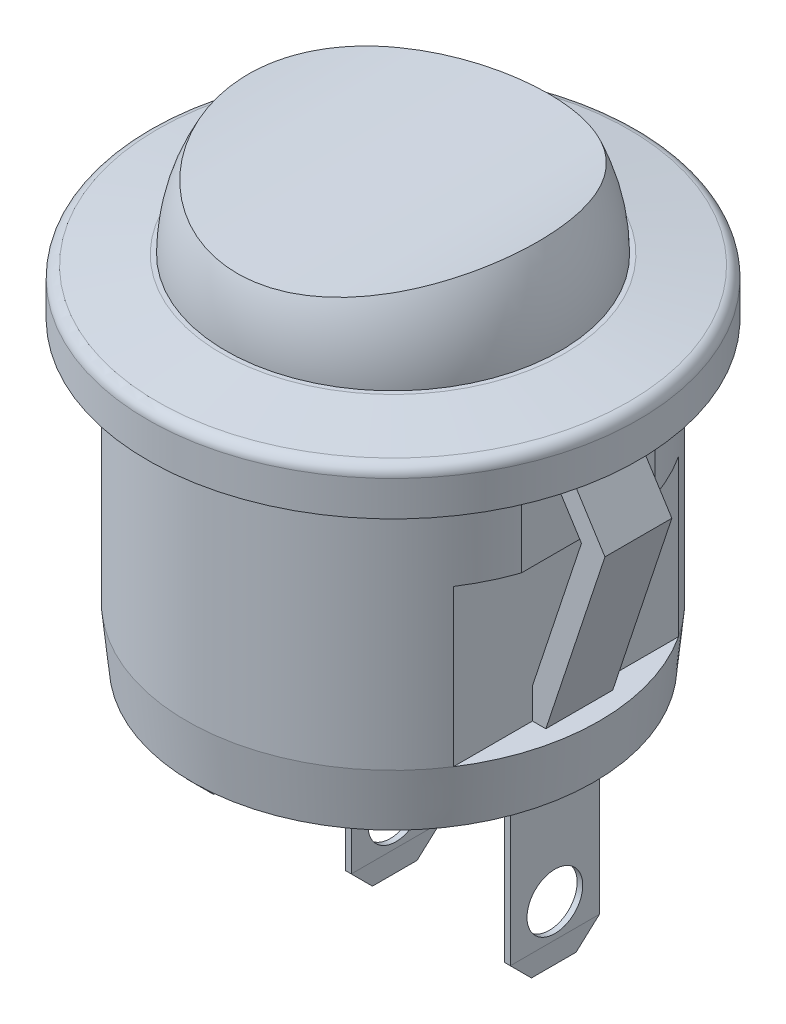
ISO-10303-21;
HEADER;
FILE_DESCRIPTION(('STEP AP214'),'2;1');
FILE_NAME('part.step','',(''),(''),'','','');
FILE_SCHEMA(('AUTOMOTIVE_DESIGN { 1 0 10303 214 1 1 1 1 }'));
ENDSEC;
DATA;
#1=APPLICATION_CONTEXT('core data for automotive mechanical design processes');
#2=APPLICATION_PROTOCOL_DEFINITION('international standard','automotive_design',2000,#1);
#3=PRODUCT_CONTEXT('',#1,'mechanical');
#4=PRODUCT('Part','Part','',(#3));
#5=PRODUCT_RELATED_PRODUCT_CATEGORY('part','',(#4));
#6=PRODUCT_DEFINITION_FORMATION('','',#4);
#7=PRODUCT_DEFINITION_CONTEXT('part definition',#1,'design');
#8=PRODUCT_DEFINITION('design','',#6,#7);
#9=PRODUCT_DEFINITION_SHAPE('','',#8);
#10=(LENGTH_UNIT() NAMED_UNIT(*) SI_UNIT(.MILLI.,.METRE.));
#11=(NAMED_UNIT(*) PLANE_ANGLE_UNIT() SI_UNIT($,.RADIAN.));
#12=(NAMED_UNIT(*) SI_UNIT($,.STERADIAN.) SOLID_ANGLE_UNIT());
#13=UNCERTAINTY_MEASURE_WITH_UNIT(LENGTH_MEASURE(1.E-05),#10,'distance_accuracy_value','');
#14=(GEOMETRIC_REPRESENTATION_CONTEXT(3) GLOBAL_UNCERTAINTY_ASSIGNED_CONTEXT((#13)) GLOBAL_UNIT_ASSIGNED_CONTEXT((#10,
#11,#12)) REPRESENTATION_CONTEXT('',''));
#15=CARTESIAN_POINT('',(0.,0.,0.));
#16=DIRECTION('',(0.,0.,1.));
#17=DIRECTION('',(1.,0.,0.));
#18=AXIS2_PLACEMENT_3D('',#15,#16,#17);
#19=CARTESIAN_POINT('',(0.,0.,0.));
#20=DIRECTION('',(0.,-1.,0.));
#21=DIRECTION('',(1.,0.,0.));
#22=AXIS2_PLACEMENT_3D('',#19,#20,#21);
#23=PLANE('',#22);
#24=CARTESIAN_POINT('',(0.,0.,0.));
#25=DIRECTION('',(0.,-1.,0.));
#26=DIRECTION('',(1.,0.,0.));
#27=AXIS2_PLACEMENT_3D('',#24,#25,#26);
#28=CIRCLE('',#27,8.99999999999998);
#29=CARTESIAN_POINT('',(8.99999999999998,0.,0.));
#30=VERTEX_POINT('',#29);
#31=EDGE_CURVE('E872',#30,#30,#28,.T.);
#32=ORIENTED_EDGE('',*,*,#31,.T.);
#33=EDGE_LOOP('',(#32));
#34=FACE_BOUND('',#33,.T.);
#35=DIRECTION('',(1.,0.,0.));
#36=VECTOR('',#35,1.);
#37=CARTESIAN_POINT('',(0.125,0.,-2.));
#38=LINE('',#37,#36);
#39=CARTESIAN_POINT('',(-0.125,0.,-2.));
#40=VERTEX_POINT('',#39);
#41=CARTESIAN_POINT('',(0.125,0.,-2.));
#42=VERTEX_POINT('',#41);
#43=EDGE_CURVE('E370',#40,#42,#38,.T.);
#44=ORIENTED_EDGE('',*,*,#43,.F.);
#45=DIRECTION('',(0.,0.,-1.));
#46=VECTOR('',#45,1.);
#47=CARTESIAN_POINT('',(-0.125,0.,-2.));
#48=LINE('',#47,#46);
#49=CARTESIAN_POINT('',(-0.125,0.,2.));
#50=VERTEX_POINT('',#49);
#51=EDGE_CURVE('E367',#50,#40,#48,.T.);
#52=ORIENTED_EDGE('',*,*,#51,.F.);
#53=DIRECTION('',(-1.,0.,0.));
#54=VECTOR('',#53,1.);
#55=CARTESIAN_POINT('',(0.125,0.,2.));
#56=LINE('',#55,#54);
#57=CARTESIAN_POINT('',(0.125,0.,2.));
#58=VERTEX_POINT('',#57);
#59=EDGE_CURVE('E376',#58,#50,#56,.T.);
#60=ORIENTED_EDGE('',*,*,#59,.F.);
#61=DIRECTION('',(0.,0.,1.));
#62=VECTOR('',#61,1.);
#63=CARTESIAN_POINT('',(0.125,0.,-2.));
#64=LINE('',#63,#62);
#65=EDGE_CURVE('E373',#42,#58,#64,.T.);
#66=ORIENTED_EDGE('',*,*,#65,.F.);
#67=EDGE_LOOP('',(#44,#52,#60,#66));
#68=FACE_BOUND('',#67,.T.);
#69=DIRECTION('',(1.,0.,0.));
#70=VECTOR('',#69,1.);
#71=CARTESIAN_POINT('',(7.255,0.,-2.));
#72=LINE('',#71,#70);
#73=CARTESIAN_POINT('',(7.005,0.,-2.));
#74=VERTEX_POINT('',#73);
#75=CARTESIAN_POINT('',(7.255,0.,-2.));
#76=VERTEX_POINT('',#75);
#77=EDGE_CURVE('E350',#74,#76,#72,.T.);
#78=ORIENTED_EDGE('',*,*,#77,.F.);
#79=DIRECTION('',(0.,0.,-1.));
#80=VECTOR('',#79,1.);
#81=CARTESIAN_POINT('',(7.005,0.,-2.));
#82=LINE('',#81,#80);
#83=CARTESIAN_POINT('',(7.005,0.,2.));
#84=VERTEX_POINT('',#83);
#85=EDGE_CURVE('E322',#84,#74,#82,.T.);
#86=ORIENTED_EDGE('',*,*,#85,.F.);
#87=DIRECTION('',(-1.,0.,0.));
#88=VECTOR('',#87,1.);
#89=CARTESIAN_POINT('',(7.255,0.,2.));
#90=LINE('',#89,#88);
#91=CARTESIAN_POINT('',(7.255,0.,2.));
#92=VERTEX_POINT('',#91);
#93=EDGE_CURVE('E356',#92,#84,#90,.T.);
#94=ORIENTED_EDGE('',*,*,#93,.F.);
#95=DIRECTION('',(0.,0.,1.));
#96=VECTOR('',#95,1.);
#97=CARTESIAN_POINT('',(7.255,0.,-2.));
#98=LINE('',#97,#96);
#99=EDGE_CURVE('E353',#76,#92,#98,.T.);
#100=ORIENTED_EDGE('',*,*,#99,.F.);
#101=EDGE_LOOP('',(#78,#86,#94,#100));
#102=FACE_BOUND('',#101,.T.);
#103=DIRECTION('',(1.,0.,0.));
#104=VECTOR('',#103,1.);
#105=CARTESIAN_POINT('',(-7.005,0.,-2.00000000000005));
#106=LINE('',#105,#104);
#107=CARTESIAN_POINT('',(-7.255,0.,-2.00000000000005));
#108=VERTEX_POINT('',#107);
#109=CARTESIAN_POINT('',(-7.005,0.,-2.00000000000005));
#110=VERTEX_POINT('',#109);
#111=EDGE_CURVE('E318',#108,#110,#106,.T.);
#112=ORIENTED_EDGE('',*,*,#111,.F.);
#113=DIRECTION('',(0.,0.,-1.));
#114=VECTOR('',#113,1.);
#115=CARTESIAN_POINT('',(-7.255,0.,-2.00000000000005));
#116=LINE('',#115,#114);
#117=CARTESIAN_POINT('',(-7.255,0.,1.99999999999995));
#118=VERTEX_POINT('',#117);
#119=EDGE_CURVE('E326',#118,#108,#116,.T.);
#120=ORIENTED_EDGE('',*,*,#119,.F.);
#121=DIRECTION('',(-1.,0.,0.));
#122=VECTOR('',#121,1.);
#123=CARTESIAN_POINT('',(-7.005,0.,1.99999999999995));
#124=LINE('',#123,#122);
#125=CARTESIAN_POINT('',(-7.005,0.,1.99999999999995));
#126=VERTEX_POINT('',#125);
#127=EDGE_CURVE('E338',#126,#118,#124,.T.);
#128=ORIENTED_EDGE('',*,*,#127,.F.);
#129=DIRECTION('',(0.,0.,1.));
#130=VECTOR('',#129,1.);
#131=CARTESIAN_POINT('',(-7.005,0.,-2.00000000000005));
#132=LINE('',#131,#130);
#133=EDGE_CURVE('E336',#110,#126,#132,.T.);
#134=ORIENTED_EDGE('',*,*,#133,.F.);
#135=EDGE_LOOP('',(#112,#120,#128,#134));
#136=FACE_BOUND('',#135,.T.);
#137=ADVANCED_FACE('F38',(#34,#68,#102,#136),#23,.T.);
#138=CARTESIAN_POINT('',(0.,16.,0.));
#139=DIRECTION('',(0.,1.,0.));
#140=DIRECTION('',(-1.,0.,0.));
#141=AXIS2_PLACEMENT_3D('',#138,#139,#140);
#142=CYLINDRICAL_SURFACE('',#141,9.25);
#143=DIRECTION('',(0.,1.,0.));
#144=VECTOR('',#143,1.);
#145=CARTESIAN_POINT('',(-7.75,16.,5.04975246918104));
#146=LINE('',#145,#144);
#147=CARTESIAN_POINT('',(-7.75,9.5,5.04975246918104));
#148=VERTEX_POINT('',#147);
#149=CARTESIAN_POINT('',(-7.75,2.5,5.04975246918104));
#150=VERTEX_POINT('',#149);
#151=EDGE_CURVE('E901',#148,#150,#146,.F.);
#152=ORIENTED_EDGE('',*,*,#151,.T.);
#153=CARTESIAN_POINT('',(0.,2.50000000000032,0.));
#154=DIRECTION('',(0.,-1.,0.));
#155=DIRECTION('',(1.,0.,0.));
#156=AXIS2_PLACEMENT_3D('',#153,#154,#155);
#157=CIRCLE('',#156,9.25);
#158=CARTESIAN_POINT('',(7.75,2.5,5.04975246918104));
#159=VERTEX_POINT('',#158);
#160=EDGE_CURVE('E878',#150,#159,#157,.F.);
#161=ORIENTED_EDGE('',*,*,#160,.T.);
#162=DIRECTION('',(0.,1.,0.));
#163=VECTOR('',#162,1.);
#164=CARTESIAN_POINT('',(7.75,16.,5.04975246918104));
#165=LINE('',#164,#163);
#166=CARTESIAN_POINT('',(7.75,9.5,5.04975246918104));
#167=VERTEX_POINT('',#166);
#168=EDGE_CURVE('E889',#167,#159,#165,.F.);
#169=ORIENTED_EDGE('',*,*,#168,.F.);
#170=CARTESIAN_POINT('',(0.,9.5,0.));
#171=DIRECTION('',(0.,1.,0.));
#172=DIRECTION('',(0.,0.,1.));
#173=AXIS2_PLACEMENT_3D('',#170,#171,#172);
#174=CIRCLE('',#173,9.25);
#175=CARTESIAN_POINT('',(8.75,9.5,3.));
#176=VERTEX_POINT('',#175);
#177=EDGE_CURVE('E892',#176,#167,#174,.F.);
#178=ORIENTED_EDGE('',*,*,#177,.F.);
#179=DIRECTION('',(0.,1.,0.));
#180=VECTOR('',#179,1.);
#181=CARTESIAN_POINT('',(8.75,16.,3.00000000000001));
#182=LINE('',#181,#180);
#183=CARTESIAN_POINT('',(8.75,13.5,3.00000000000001));
#184=VERTEX_POINT('',#183);
#185=EDGE_CURVE('E533',#184,#176,#182,.F.);
#186=ORIENTED_EDGE('',*,*,#185,.F.);
#187=CARTESIAN_POINT('',(0.,13.5,0.));
#188=DIRECTION('',(0.,1.,0.));
#189=DIRECTION('',(-1.,0.,0.));
#190=AXIS2_PLACEMENT_3D('',#187,#188,#189);
#191=CIRCLE('',#190,9.25);
#192=CARTESIAN_POINT('',(-8.75,13.5,3.00000000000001));
#193=VERTEX_POINT('',#192);
#194=EDGE_CURVE('E542',#193,#184,#191,.T.);
#195=ORIENTED_EDGE('',*,*,#194,.F.);
#196=DIRECTION('',(0.,1.,0.));
#197=VECTOR('',#196,1.);
#198=CARTESIAN_POINT('',(-8.75,16.,3.));
#199=LINE('',#198,#197);
#200=CARTESIAN_POINT('',(-8.75,9.5,3.));
#201=VERTEX_POINT('',#200);
#202=EDGE_CURVE('E528',#193,#201,#199,.F.);
#203=ORIENTED_EDGE('',*,*,#202,.T.);
#204=CARTESIAN_POINT('',(0.,9.5,0.));
#205=DIRECTION('',(0.,-1.,0.));
#206=DIRECTION('',(0.,0.,-1.));
#207=AXIS2_PLACEMENT_3D('',#204,#205,#206);
#208=CIRCLE('',#207,9.25);
#209=EDGE_CURVE('E904',#201,#148,#208,.F.);
#210=ORIENTED_EDGE('',*,*,#209,.T.);
#211=EDGE_LOOP('',(#152,#161,#169,#178,#186,#195,#203,#210));
#212=FACE_BOUND('',#211,.T.);
#213=ADVANCED_FACE('F723',(#212),#142,.T.);
#214=DIRECTION('',(0.,1.,0.));
#215=VECTOR('',#214,1.);
#216=CARTESIAN_POINT('',(7.75,16.,-5.04975246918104));
#217=LINE('',#216,#215);
#218=CARTESIAN_POINT('',(7.75,2.5,-5.04975246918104));
#219=VERTEX_POINT('',#218);
#220=CARTESIAN_POINT('',(7.75,9.5,-5.04975246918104));
#221=VERTEX_POINT('',#220);
#222=EDGE_CURVE('E884',#219,#221,#217,.T.);
#223=ORIENTED_EDGE('',*,*,#222,.F.);
#224=CARTESIAN_POINT('',(0.,2.50000000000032,0.));
#225=DIRECTION('',(0.,-1.,0.));
#226=DIRECTION('',(1.,0.,0.));
#227=AXIS2_PLACEMENT_3D('',#224,#225,#226);
#228=CIRCLE('',#227,9.25);
#229=CARTESIAN_POINT('',(-7.75,2.5,-5.04975246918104));
#230=VERTEX_POINT('',#229);
#231=EDGE_CURVE('E881',#219,#230,#228,.F.);
#232=ORIENTED_EDGE('',*,*,#231,.T.);
#233=DIRECTION('',(0.,1.,0.));
#234=VECTOR('',#233,1.);
#235=CARTESIAN_POINT('',(-7.75,16.,-5.04975246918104));
#236=LINE('',#235,#234);
#237=CARTESIAN_POINT('',(-7.75,9.5,-5.04975246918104));
#238=VERTEX_POINT('',#237);
#239=EDGE_CURVE('E895',#230,#238,#236,.T.);
#240=ORIENTED_EDGE('',*,*,#239,.T.);
#241=CARTESIAN_POINT('',(-8.75,9.5,-3.));
#242=VERTEX_POINT('',#241);
#243=EDGE_CURVE('E894',#238,#242,#208,.F.);
#244=ORIENTED_EDGE('',*,*,#243,.T.);
#245=DIRECTION('',(0.,1.,0.));
#246=VECTOR('',#245,1.);
#247=CARTESIAN_POINT('',(-8.75,16.,-3.));
#248=LINE('',#247,#246);
#249=CARTESIAN_POINT('',(-8.75,13.5,-3.00000000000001));
#250=VERTEX_POINT('',#249);
#251=EDGE_CURVE('E506',#242,#250,#248,.T.);
#252=ORIENTED_EDGE('',*,*,#251,.T.);
#253=CARTESIAN_POINT('',(8.75,13.5,-3.00000000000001));
#254=VERTEX_POINT('',#253);
#255=EDGE_CURVE('E539',#254,#250,#191,.T.);
#256=ORIENTED_EDGE('',*,*,#255,.F.);
#257=DIRECTION('',(0.,1.,0.));
#258=VECTOR('',#257,1.);
#259=CARTESIAN_POINT('',(8.75,16.,-3.00000000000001));
#260=LINE('',#259,#258);
#261=CARTESIAN_POINT('',(8.75,9.5,-3.));
#262=VERTEX_POINT('',#261);
#263=EDGE_CURVE('E531',#262,#254,#260,.T.);
#264=ORIENTED_EDGE('',*,*,#263,.F.);
#265=EDGE_CURVE('E883',#221,#262,#174,.F.);
#266=ORIENTED_EDGE('',*,*,#265,.F.);
#267=EDGE_LOOP('',(#223,#232,#240,#244,#252,#256,#264,#266));
#268=FACE_BOUND('',#267,.T.);
#269=ADVANCED_FACE('F729',(#268),#142,.T.);
#270=CARTESIAN_POINT('',(0.,16.,0.));
#271=DIRECTION('',(0.,1.,0.));
#272=DIRECTION('',(1.,0.,0.));
#273=AXIS2_PLACEMENT_3D('',#270,#271,#272);
#274=SPHERICAL_SURFACE('',#273,7.5);
#275=CARTESIAN_POINT('',(0.,16.,0.));
#276=DIRECTION('',(0.,1.,0.));
#277=DIRECTION('',(-1.,0.,0.));
#278=AXIS2_PLACEMENT_3D('',#275,#276,#277);
#279=CIRCLE('',#278,7.5);
#280=CARTESIAN_POINT('',(-7.5,16.,0.));
#281=VERTEX_POINT('',#280);
#282=EDGE_CURVE('E543',#281,#281,#279,.T.);
#283=ORIENTED_EDGE('',*,*,#282,.T.);
#284=EDGE_LOOP('',(#283));
#285=FACE_BOUND('',#284,.T.);
#286=CARTESIAN_POINT('',(0.000200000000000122,18.7416573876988,-6.9809250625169));
#287=CARTESIAN_POINT('',(-0.172544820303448,18.7416562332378,-6.98092995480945));
#288=CARTESIAN_POINT('',(-0.345305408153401,18.7437293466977,-6.97370443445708));
#289=CARTESIAN_POINT('',(-0.689588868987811,18.751968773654,-6.94485497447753));
#290=CARTESIAN_POINT('',(-0.86111116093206,18.7581368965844,-6.92322466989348));
#291=CARTESIAN_POINT('',(-1.20182274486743,18.774404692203,-6.86573059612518));
#292=CARTESIAN_POINT('',(-1.37100824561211,18.7845101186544,-6.82984599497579));
#293=CARTESIAN_POINT('',(-1.70562481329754,18.8083731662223,-6.74417277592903));
#294=CARTESIAN_POINT('',(-1.87105436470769,18.8221322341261,-6.69437864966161));
#295=CARTESIAN_POINT('',(-2.19645886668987,18.8528751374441,-6.58152537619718));
#296=CARTESIAN_POINT('',(-2.3564484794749,18.8698493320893,-6.51850582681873));
#297=CARTESIAN_POINT('',(-2.67049836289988,18.9065998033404,-6.37965066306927));
#298=CARTESIAN_POINT('',(-2.82455637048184,18.926377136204,-6.30381021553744));
#299=CARTESIAN_POINT('',(-3.12563367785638,18.9681965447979,-6.14003322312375));
#300=CARTESIAN_POINT('',(-3.2726577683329,18.9902370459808,-6.0521050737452));
#301=CARTESIAN_POINT('',(-3.55900398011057,19.0360420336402,-5.86478874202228));
#302=CARTESIAN_POINT('',(-3.69832313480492,19.0598071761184,-5.76539619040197));
#303=CARTESIAN_POINT('',(-3.97204959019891,19.1091105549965,-5.5531663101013));
#304=CARTESIAN_POINT('',(-4.1062295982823,19.1346790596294,-5.44004296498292));
#305=CARTESIAN_POINT('',(-4.36502163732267,19.1863685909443,-5.20337091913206));
#306=CARTESIAN_POINT('',(-4.48963020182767,19.2124898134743,-5.07981847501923));
#307=CARTESIAN_POINT('',(-4.72864775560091,19.2646319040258,-4.82322377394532));
#308=CARTESIAN_POINT('',(-4.8430577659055,19.2906527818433,-4.69018246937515));
#309=CARTESIAN_POINT('',(-5.06125559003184,19.3419841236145,-4.41545889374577));
#310=CARTESIAN_POINT('',(-5.1650395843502,19.3672943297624,-4.27377354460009));
#311=CARTESIAN_POINT('',(-5.36847659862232,19.4183436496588,-3.97245648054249));
#312=CARTESIAN_POINT('',(-5.46732327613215,19.4439873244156,-3.81226368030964));
#313=CARTESIAN_POINT('',(-5.65195544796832,19.4931058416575,-3.4841997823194));
#314=CARTESIAN_POINT('',(-5.73774019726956,19.5165805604,-3.31632824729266));
#315=CARTESIAN_POINT('',(-5.89596443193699,19.5607692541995,-2.97398464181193));
#316=CARTESIAN_POINT('',(-5.96839890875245,19.5814821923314,-2.79951012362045));
#317=CARTESIAN_POINT('',(-6.09962040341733,19.6196112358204,-2.44521706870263));
#318=CARTESIAN_POINT('',(-6.15841138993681,19.6370282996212,-2.26540010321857));
#319=CARTESIAN_POINT('',(-6.26507205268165,19.6690059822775,-1.8914055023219));
#320=CARTESIAN_POINT('',(-6.31215441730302,19.6833543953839,-1.69698475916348));
#321=CARTESIAN_POINT('',(-6.39077089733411,19.7075101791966,-1.30481624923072));
#322=CARTESIAN_POINT('',(-6.42230991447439,19.7173189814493,-1.10706955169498));
#323=CARTESIAN_POINT('',(-6.46977480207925,19.7321411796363,-0.709436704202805));
#324=CARTESIAN_POINT('',(-6.48569317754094,19.7371522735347,-0.509549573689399));
#325=CARTESIAN_POINT('',(-6.50183843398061,19.7422351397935,-0.109147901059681));
#326=CARTESIAN_POINT('',(-6.50207048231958,19.7423085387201,0.0913664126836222));
#327=CARTESIAN_POINT('',(-6.486665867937,19.7374581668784,0.496717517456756));
#328=CARTESIAN_POINT('',(-6.47063492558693,19.7324102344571,0.701537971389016));
#329=CARTESIAN_POINT('',(-6.4221565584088,19.7172706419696,1.10903723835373));
#330=CARTESIAN_POINT('',(-6.38970921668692,19.7071790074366,1.31171606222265));
#331=CARTESIAN_POINT('',(-6.30850151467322,19.6822372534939,1.71350649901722));
#332=CARTESIAN_POINT('',(-6.25973938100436,19.6673866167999,1.91261772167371));
#333=CARTESIAN_POINT('',(-6.14607381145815,19.6333528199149,2.30579462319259));
#334=CARTESIAN_POINT('',(-6.08117092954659,19.6141698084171,2.49986047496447));
#335=CARTESIAN_POINT('',(-5.93560280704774,19.5720674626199,2.88113785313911));
#336=CARTESIAN_POINT('',(-5.85496833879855,19.5491554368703,3.06836192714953));
#337=CARTESIAN_POINT('',(-5.67821126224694,19.500250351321,3.43484084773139));
#338=CARTESIAN_POINT('',(-5.58209504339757,19.4742585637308,3.61409894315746));
#339=CARTESIAN_POINT('',(-5.37473106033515,19.4199541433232,3.96335398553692));
#340=CARTESIAN_POINT('',(-5.26347851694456,19.3916407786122,4.13334798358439));
#341=CARTESIAN_POINT('',(-5.02644420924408,19.3335796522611,4.46251732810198));
#342=CARTESIAN_POINT('',(-4.90066909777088,19.3038325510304,4.62169757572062));
#343=CARTESIAN_POINT('',(-4.63945781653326,19.2447871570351,4.92301829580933));
#344=CARTESIAN_POINT('',(-4.504458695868,19.2155048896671,5.06554069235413));
#345=CARTESIAN_POINT('',(-4.22223148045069,19.1573639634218,5.33789245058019));
#346=CARTESIAN_POINT('',(-4.07500886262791,19.12850512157,5.46772744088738));
#347=CARTESIAN_POINT('',(-3.76913367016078,19.0720936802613,5.7135963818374));
#348=CARTESIAN_POINT('',(-3.61047740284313,19.04454150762,5.82962584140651));
#349=CARTESIAN_POINT('',(-3.28286110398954,18.9916494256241,6.04666496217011));
#350=CARTESIAN_POINT('',(-3.11390207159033,18.966309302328,6.14767607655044));
#351=CARTESIAN_POINT('',(-2.77821795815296,18.9202372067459,6.32756568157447));
#352=CARTESIAN_POINT('',(-2.61206093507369,18.8993128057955,6.40745575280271));
#353=CARTESIAN_POINT('',(-2.27302734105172,18.860772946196,6.55237930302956));
#354=CARTESIAN_POINT('',(-2.10015147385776,18.8431571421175,6.61741433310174));
#355=CARTESIAN_POINT('',(-1.74936170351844,18.8118133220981,6.73183873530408));
#356=CARTESIAN_POINT('',(-1.57145926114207,18.7980771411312,6.78126099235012));
#357=CARTESIAN_POINT('',(-1.21177121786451,18.7748839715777,6.86409472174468));
#358=CARTESIAN_POINT('',(-1.02998770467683,18.7654247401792,6.89751458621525));
#359=CARTESIAN_POINT('',(-0.706757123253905,18.7527534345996,6.94211270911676));
#360=CARTESIAN_POINT('',(-0.565802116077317,18.7485984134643,6.95666216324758));
#361=CARTESIAN_POINT('',(-0.283168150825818,18.7430495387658,6.97607095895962));
#362=CARTESIAN_POINT('',(-0.141489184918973,18.7416557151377,6.98093019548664));
#363=CARTESIAN_POINT('',(0.17294652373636,18.7416594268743,6.98091880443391));
#364=CARTESIAN_POINT('',(0.345708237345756,18.7437357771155,6.97368198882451));
#365=CARTESIAN_POINT('',(0.68999289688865,18.7519816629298,6.94480977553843));
#366=CARTESIAN_POINT('',(0.861515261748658,18.7581530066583,6.9231680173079));
#367=CARTESIAN_POINT('',(1.20222576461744,18.7744271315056,6.86565100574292));
#368=CARTESIAN_POINT('',(1.37141011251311,18.7845356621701,6.82975493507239));
#369=CARTESIAN_POINT('',(1.70602336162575,18.8084047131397,6.74405886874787));
#370=CARTESIAN_POINT('',(1.87145074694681,18.8221666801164,6.69425336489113));
#371=CARTESIAN_POINT('',(2.19684996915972,18.8529150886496,6.58137756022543));
#372=CARTESIAN_POINT('',(2.3568364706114,18.8698918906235,6.5183468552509));
#373=CARTESIAN_POINT('',(2.67087921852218,18.9066472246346,6.37946965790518));
#374=CARTESIAN_POINT('',(2.82493320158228,18.9264268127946,6.30361833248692));
#375=CARTESIAN_POINT('',(3.12600166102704,18.9682503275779,6.13981992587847));
#376=CARTESIAN_POINT('',(3.27302092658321,18.9902926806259,6.05188123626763));
#377=CARTESIAN_POINT('',(3.55935670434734,19.0361009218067,5.86454423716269));
#378=CARTESIAN_POINT('',(3.69867024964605,19.0598674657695,5.76514155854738));
#379=CARTESIAN_POINT('',(3.97238528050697,19.1091733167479,5.55289111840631));
#380=CARTESIAN_POINT('',(4.10655941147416,19.1347428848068,5.43975729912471));
#381=CARTESIAN_POINT('',(4.36533891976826,19.1864340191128,5.20306475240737));
#382=CARTESIAN_POINT('',(4.48994083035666,19.2125557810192,5.07950228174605));
#383=CARTESIAN_POINT('',(4.72894435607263,19.2646984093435,4.82288804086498));
#384=CARTESIAN_POINT('',(4.84334699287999,19.290719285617,4.68983722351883));
#385=CARTESIAN_POINT('',(5.06152941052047,19.3420500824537,4.41509517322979));
#386=CARTESIAN_POINT('',(5.16530537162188,19.3673597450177,4.27340086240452));
#387=CARTESIAN_POINT('',(5.36872517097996,19.4184073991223,3.97206579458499));
#388=CARTESIAN_POINT('',(5.46756261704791,19.444049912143,3.81186399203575));
#389=CARTESIAN_POINT('',(5.65217567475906,19.4931655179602,3.48378281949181));
#390=CARTESIAN_POINT('',(5.73795054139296,19.5166384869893,3.31590301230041));
#391=CARTESIAN_POINT('',(5.89615440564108,19.5608231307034,2.97354363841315));
#392=CARTESIAN_POINT('',(5.96857839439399,19.5815337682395,2.79906162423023));
#393=CARTESIAN_POINT('',(6.09977835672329,19.6196577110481,2.44475441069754));
#394=CARTESIAN_POINT('',(6.1585582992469,19.6370719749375,2.2649307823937));
#395=CARTESIAN_POINT('',(6.26519542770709,19.6690433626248,1.89092443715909));
#396=CARTESIAN_POINT('',(6.31226535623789,19.6833882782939,1.69649868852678));
#397=CARTESIAN_POINT('',(6.39085660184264,19.7075367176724,1.3043212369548));
#398=CARTESIAN_POINT('',(6.42238282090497,19.7173416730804,1.10657060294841));
#399=CARTESIAN_POINT('',(6.46982178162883,19.7321559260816,0.708930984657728));
#400=CARTESIAN_POINT('',(6.48572702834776,19.7371629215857,0.509041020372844));
#401=CARTESIAN_POINT('',(6.50184574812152,19.7422374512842,0.108634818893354));
#402=CARTESIAN_POINT('',(6.50206438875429,19.7423066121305,-0.0918811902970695));
#403=CARTESIAN_POINT('',(6.48663242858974,19.7374476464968,-0.497233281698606));
#404=CARTESIAN_POINT('',(6.47058764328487,19.7323953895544,-0.702053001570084));
#405=CARTESIAN_POINT('',(6.42208158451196,19.7172473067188,-1.10954957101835));
#406=CARTESIAN_POINT('',(6.38962039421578,19.7071515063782,-1.31222643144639));
#407=CARTESIAN_POINT('',(6.30838503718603,19.682201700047,-1.71401170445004));
#408=CARTESIAN_POINT('',(6.25960909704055,19.6673471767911,-1.91311972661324));
#409=CARTESIAN_POINT('',(6.1459160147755,19.6333060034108,-2.30628898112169));
#410=CARTESIAN_POINT('',(6.08099942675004,19.6141195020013,-2.50035038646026));
#411=CARTESIAN_POINT('',(5.93540447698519,19.5720108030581,-2.88161659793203));
#412=CARTESIAN_POINT('',(5.85475697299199,19.5490959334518,-3.06883398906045));
#413=CARTESIAN_POINT('',(5.67797423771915,19.5001857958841,-3.43529838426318));
#414=CARTESIAN_POINT('',(5.58184539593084,19.4741917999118,-3.61454863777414));
#415=CARTESIAN_POINT('',(5.37445666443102,19.4198836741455,-3.96378683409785));
#416=CARTESIAN_POINT('',(5.2631919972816,19.391568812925,-4.13377182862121));
#417=CARTESIAN_POINT('',(5.0261340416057,19.3335054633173,-4.46292205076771));
#418=CARTESIAN_POINT('',(4.90034740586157,19.3037576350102,-4.62209218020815));
#419=CARTESIAN_POINT('',(4.63911514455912,19.2447118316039,-4.92339076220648));
#420=CARTESIAN_POINT('',(4.50410664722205,19.2154298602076,-5.06590126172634));
#421=CARTESIAN_POINT('',(4.22186165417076,19.157290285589,-5.33822845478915));
#422=CARTESIAN_POINT('',(4.07463063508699,19.1284324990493,-5.4680507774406));
#423=CARTESIAN_POINT('',(3.76873967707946,19.0720238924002,-5.71389371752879));
#424=CARTESIAN_POINT('',(3.61007604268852,19.0444734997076,-5.82990983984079));
#425=CARTESIAN_POINT('',(3.28244620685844,18.9915856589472,-6.04692167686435));
#426=CARTESIAN_POINT('',(3.11348100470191,18.966247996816,-6.14791884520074));
#427=CARTESIAN_POINT('',(2.7777870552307,18.9201813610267,-6.32778054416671));
#428=CARTESIAN_POINT('',(2.61162632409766,18.8992599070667,-6.40765675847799));
#429=CARTESIAN_POINT('',(2.27258660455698,18.8607263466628,-6.5525524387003));
#430=CARTESIAN_POINT('',(2.09970831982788,18.8431138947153,-6.61757345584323));
#431=CARTESIAN_POINT('',(1.74891525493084,18.8117770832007,-6.73196978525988));
#432=CARTESIAN_POINT('',(1.57101193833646,18.798044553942,-6.78137799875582));
#433=CARTESIAN_POINT('',(1.21132352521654,18.7748588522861,-6.86418380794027));
#434=CARTESIAN_POINT('',(1.02954051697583,18.7654034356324,-6.89758980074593));
#435=CARTESIAN_POINT('',(0.706449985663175,18.7527442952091,-6.94214470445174));
#436=CARTESIAN_POINT('',(0.565635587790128,18.748594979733,-6.95667417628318));
#437=CARTESIAN_POINT('',(0.283284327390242,18.7430519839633,-6.97606240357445));
#438=CARTESIAN_POINT('',(0.141747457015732,18.7416583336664,-6.98092105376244));
#439=CARTESIAN_POINT('',(0.000200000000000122,18.7416573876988,-6.9809250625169));
#440=B_SPLINE_CURVE_WITH_KNOTS('',3,(#286,#287,#288,#289,#290,#291,#292,#293,#294,#295,#296,
#297,#298,#299,#300,#301,#302,#303,#304,#305,#306,#307,#308,#309,#310,#311,#312,#313,#314,#315,
#316,#317,#318,#319,#320,#321,#322,#323,#324,#325,#326,#327,#328,#329,#330,#331,#332,#333,#334,
#335,#336,#337,#338,#339,#340,#341,#342,#343,#344,#345,#346,#347,#348,#349,#350,#351,#352,#353,
#354,#355,#356,#357,#358,#359,#360,#361,#362,#363,#364,#365,#366,#367,#368,#369,#370,#371,#372,
#373,#374,#375,#376,#377,#378,#379,#380,#381,#382,#383,#384,#385,#386,#387,#388,#389,#390,#391,
#392,#393,#394,#395,#396,#397,#398,#399,#400,#401,#402,#403,#404,#405,#406,#407,#408,#409,#410,
#411,#412,#413,#414,#415,#416,#417,#418,#419,#420,#421,#422,#423,#424,#425,#426,#427,#428,#429,
#430,#431,#432,#433,#434,#435,#436,#437,#438,#439),.UNSPECIFIED.,.T.,.F.,(4,2,2,2,2,2,2,2,2,2,2,
2,2,2,2,2,2,2,2,2,2,2,2,2,2,2,2,2,2,2,2,2,2,2,2,2,2,2,2,2,2,2,2,2,2,2,2,2,2,2,2,2,2,2,2,2,2,2,2,
2,2,2,2,2,2,2,2,2,2,2,2,2,2,2,2,2,4),(0.,0.518098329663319,1.03642574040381,1.55551346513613,
2.07480704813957,2.59256746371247,3.11052349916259,3.62812158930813,4.14591760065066,
4.67740535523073,5.20908469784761,5.74071075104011,6.27252723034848,6.84181625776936,
7.41113774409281,7.98067238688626,8.55004115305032,9.15101275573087,9.75179471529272,
10.3528647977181,10.953736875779,11.569533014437,12.1853260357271,12.8011860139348,
13.4170248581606,14.0316709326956,14.6460639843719,15.2606514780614,15.8749585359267,
16.4696389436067,17.0640543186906,17.6586625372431,18.2532131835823,18.8091357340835,
19.3650002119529,19.9196859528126,20.4740804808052,20.8990316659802,21.3239874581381,
21.8420907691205,22.3604230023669,22.8795150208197,23.3988128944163,23.9165776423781,
24.4345380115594,24.9521405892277,25.4699410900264,26.0014360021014,26.5331225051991,
27.0647556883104,27.5965792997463,28.1658762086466,28.7352055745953,29.3047481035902,
29.8741247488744,30.4751013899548,31.0758883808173,31.6769634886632,32.2778405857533,
32.8936380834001,33.5094324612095,34.1252937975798,34.7411339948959,35.3557780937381,
35.9701691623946,36.5847546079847,37.1990596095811,37.793733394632,38.3881421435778,
38.9827438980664,39.5772880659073,40.1332016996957,40.6890572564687,41.2437335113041,
41.7981183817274,42.2226445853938,42.6471754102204),.UNSPECIFIED.);
#441=CARTESIAN_POINT('',(0.000200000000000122,18.7416573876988,-6.9809250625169));
#442=VERTEX_POINT('',#441);
#443=EDGE_CURVE('E546',#442,#442,#440,.T.);
#444=ORIENTED_EDGE('',*,*,#443,.F.);
#445=EDGE_LOOP('',(#444));
#446=FACE_BOUND('',#445,.T.);
#447=ADVANCED_FACE('F556',(#285,#446),#274,.T.);
#448=CARTESIAN_POINT('',(-9.25,13.5,0.));
#449=DIRECTION('',(0.,-1.,0.));
#450=DIRECTION('',(1.,0.,0.));
#451=AXIS2_PLACEMENT_3D('',#448,#449,#450);
#452=PLANE('',#451);
#453=DIRECTION('',(1.,0.,0.));
#454=VECTOR('',#453,1.);
#455=CARTESIAN_POINT('',(0.,13.5,1.5));
#456=LINE('',#455,#454);
#457=CARTESIAN_POINT('',(8.75,13.5,1.5));
#458=VERTEX_POINT('',#457);
#459=CARTESIAN_POINT('',(9.1,13.5,1.5));
#460=VERTEX_POINT('',#459);
#461=EDGE_CURVE('E405',#458,#460,#456,.T.);
#462=ORIENTED_EDGE('',*,*,#461,.T.);
#463=DIRECTION('',(0.,0.,-1.));
#464=VECTOR('',#463,1.);
#465=CARTESIAN_POINT('',(9.1,13.5,1.5));
#466=LINE('',#465,#464);
#467=CARTESIAN_POINT('',(9.1,13.5,-1.5));
#468=VERTEX_POINT('',#467);
#469=EDGE_CURVE('E434',#460,#468,#466,.T.);
#470=ORIENTED_EDGE('',*,*,#469,.T.);
#471=DIRECTION('',(1.,0.,0.));
#472=VECTOR('',#471,1.);
#473=CARTESIAN_POINT('',(0.,13.5,-1.5));
#474=LINE('',#473,#472);
#475=CARTESIAN_POINT('',(8.75,13.5,-1.5));
#476=VERTEX_POINT('',#475);
#477=EDGE_CURVE('E427',#476,#468,#474,.T.);
#478=ORIENTED_EDGE('',*,*,#477,.F.);
#479=DIRECTION('',(0.,0.,1.));
#480=VECTOR('',#479,1.);
#481=CARTESIAN_POINT('',(8.75,13.5,-11.));
#482=LINE('',#481,#480);
#483=EDGE_CURVE('E501',#254,#476,#482,.T.);
#484=ORIENTED_EDGE('',*,*,#483,.F.);
#485=ORIENTED_EDGE('',*,*,#255,.T.);
#486=DIRECTION('',(0.,0.,1.));
#487=VECTOR('',#486,1.);
#488=CARTESIAN_POINT('',(-8.75,13.5,-11.));
#489=LINE('',#488,#487);
#490=CARTESIAN_POINT('',(-8.75,13.5,-1.5));
#491=VERTEX_POINT('',#490);
#492=EDGE_CURVE('E523',#250,#491,#489,.T.);
#493=ORIENTED_EDGE('',*,*,#492,.T.);
#494=DIRECTION('',(-1.,0.,0.));
#495=VECTOR('',#494,1.);
#496=CARTESIAN_POINT('',(0.,13.5,-1.5));
#497=LINE('',#496,#495);
#498=CARTESIAN_POINT('',(-9.1,13.5,-1.5));
#499=VERTEX_POINT('',#498);
#500=EDGE_CURVE('E472',#491,#499,#497,.T.);
#501=ORIENTED_EDGE('',*,*,#500,.T.);
#502=DIRECTION('',(0.,0.,-1.));
#503=VECTOR('',#502,1.);
#504=CARTESIAN_POINT('',(-9.1,13.5,1.5));
#505=LINE('',#504,#503);
#506=CARTESIAN_POINT('',(-9.1,13.5,1.5));
#507=VERTEX_POINT('',#506);
#508=EDGE_CURVE('E492',#507,#499,#505,.T.);
#509=ORIENTED_EDGE('',*,*,#508,.F.);
#510=DIRECTION('',(-1.,0.,0.));
#511=VECTOR('',#510,1.);
#512=CARTESIAN_POINT('',(0.,13.5,1.5));
#513=LINE('',#512,#511);
#514=CARTESIAN_POINT('',(-8.75,13.5,1.5));
#515=VERTEX_POINT('',#514);
#516=EDGE_CURVE('E454',#515,#507,#513,.T.);
#517=ORIENTED_EDGE('',*,*,#516,.F.);
#518=EDGE_CURVE('E500',#515,#193,#489,.T.);
#519=ORIENTED_EDGE('',*,*,#518,.T.);
#520=ORIENTED_EDGE('',*,*,#194,.T.);
#521=EDGE_CURVE('E504',#458,#184,#482,.T.);
#522=ORIENTED_EDGE('',*,*,#521,.F.);
#523=EDGE_LOOP('',(#462,#470,#478,#484,#485,#493,#501,#509,#517,#519,#520,#522));
#524=FACE_BOUND('',#523,.T.);
#525=CARTESIAN_POINT('',(0.,13.5,0.));
#526=DIRECTION('',(0.,1.,0.));
#527=DIRECTION('',(-1.,0.,0.));
#528=AXIS2_PLACEMENT_3D('',#525,#526,#527);
#529=CIRCLE('',#528,11.);
#530=CARTESIAN_POINT('',(-11.,13.5,0.));
#531=VERTEX_POINT('',#530);
#532=EDGE_CURVE('E536',#531,#531,#529,.T.);
#533=ORIENTED_EDGE('',*,*,#532,.F.);
#534=EDGE_LOOP('',(#533));
#535=FACE_BOUND('',#534,.T.);
#536=ADVANCED_FACE('F924',(#524,#535),#452,.T.);
#537=CARTESIAN_POINT('',(0.,16.,0.));
#538=DIRECTION('',(0.,1.,0.));
#539=DIRECTION('',(-1.,0.,0.));
#540=AXIS2_PLACEMENT_3D('',#537,#538,#539);
#541=CYLINDRICAL_SURFACE('',#540,11.);
#542=CARTESIAN_POINT('',(0.,15.0700509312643,0.));
#543=DIRECTION('',(0.,1.,0.));
#544=DIRECTION('',(-1.,0.,0.));
#545=AXIS2_PLACEMENT_3D('',#542,#543,#544);
#546=CIRCLE('',#545,11.);
#547=CARTESIAN_POINT('',(-11.,15.0700509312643,0.));
#548=VERTEX_POINT('',#547);
#549=EDGE_CURVE('E909',#548,#548,#546,.F.);
#550=ORIENTED_EDGE('',*,*,#549,.T.);
#551=EDGE_LOOP('',(#550));
#552=FACE_BOUND('',#551,.T.);
#553=ORIENTED_EDGE('',*,*,#532,.T.);
#554=EDGE_LOOP('',(#553));
#555=FACE_BOUND('',#554,.T.);
#556=ADVANCED_FACE('F919',(#552,#555),#541,.T.);
#557=CARTESIAN_POINT('',(-11.,16.,0.));
#558=DIRECTION('',(0.,1.,0.));
#559=DIRECTION('',(-1.,0.,0.));
#560=AXIS2_PLACEMENT_3D('',#557,#558,#559);
#561=PLANE('',#560);
#562=CARTESIAN_POINT('',(0.,16.,0.));
#563=DIRECTION('',(0.,1.,0.));
#564=DIRECTION('',(-1.,0.,0.));
#565=AXIS2_PLACEMENT_3D('',#562,#563,#564);
#566=CIRCLE('',#565,7.69999999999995);
#567=CARTESIAN_POINT('',(-7.69999999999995,16.,0.));
#568=VERTEX_POINT('',#567);
#569=EDGE_CURVE('E554',#568,#568,#566,.T.);
#570=ORIENTED_EDGE('',*,*,#569,.T.);
#571=EDGE_LOOP('',(#570));
#572=FACE_BOUND('',#571,.T.);
#573=ORIENTED_EDGE('',*,*,#282,.F.);
#574=EDGE_LOOP('',(#573));
#575=FACE_BOUND('',#574,.T.);
#576=ADVANCED_FACE('F564',(#572,#575),#561,.T.);
#577=CARTESIAN_POINT('',(0.,40.3666573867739,-11.));
#578=DIRECTION('',(0.,0.,1.));
#579=DIRECTION('',(1.,0.,0.));
#580=AXIS2_PLACEMENT_3D('',#577,#578,#579);
#581=CYLINDRICAL_SURFACE('',#580,21.625);
#582=ORIENTED_EDGE('',*,*,#443,.T.);
#583=EDGE_LOOP('',(#582));
#584=FACE_BOUND('',#583,.T.);
#585=ADVANCED_FACE('F559',(#584),#581,.F.);
#586=CARTESIAN_POINT('',(0.,16.,0.));
#587=DIRECTION('',(0.,-1.,0.));
#588=DIRECTION('',(1.,0.,0.));
#589=AXIS2_PLACEMENT_3D('',#586,#587,#588);
#590=CONICAL_SURFACE('',#589,7.69999999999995,1.42042489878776);
#591=CARTESIAN_POINT('',(0.,15.5644086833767,0.));
#592=DIRECTION('',(0.,1.,0.));
#593=DIRECTION('',(-1.,0.,0.));
#594=AXIS2_PLACEMENT_3D('',#591,#592,#593);
#595=CIRCLE('',#594,10.574902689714);
#596=CARTESIAN_POINT('',(-10.574902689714,15.5644086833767,0.));
#597=VERTEX_POINT('',#596);
#598=EDGE_CURVE('E907',#597,#597,#595,.T.);
#599=ORIENTED_EDGE('',*,*,#598,.T.);
#600=EDGE_LOOP('',(#599));
#601=FACE_BOUND('',#600,.T.);
#602=ORIENTED_EDGE('',*,*,#569,.F.);
#603=EDGE_LOOP('',(#602));
#604=FACE_BOUND('',#603,.T.);
#605=ADVANCED_FACE('F563',(#601,#604),#590,.T.);
#606=CARTESIAN_POINT('',(0.,15.0700509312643,0.));
#607=DIRECTION('',(0.,1.,0.));
#608=DIRECTION('',(-1.,0.,0.));
#609=AXIS2_PLACEMENT_3D('',#606,#607,#608);
#610=TOROIDAL_SURFACE('',#609,10.5,0.5);
#611=ORIENTED_EDGE('',*,*,#598,.F.);
#612=EDGE_LOOP('',(#611));
#613=FACE_BOUND('',#612,.T.);
#614=ORIENTED_EDGE('',*,*,#549,.F.);
#615=EDGE_LOOP('',(#614));
#616=FACE_BOUND('',#615,.T.);
#617=ADVANCED_FACE('F570',(#613,#616),#610,.T.);
#618=CARTESIAN_POINT('',(-8.75,13.5,-11.));
#619=DIRECTION('',(-1.,0.,0.));
#620=DIRECTION('',(0.,0.,1.));
#621=AXIS2_PLACEMENT_3D('',#618,#619,#620);
#622=PLANE('',#621);
#623=DIRECTION('',(0.,1.,0.));
#624=VECTOR('',#623,1.);
#625=CARTESIAN_POINT('',(-8.75,0.,1.5));
#626=LINE('',#625,#624);
#627=CARTESIAN_POINT('',(-8.75,12.3893122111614,1.5));
#628=VERTEX_POINT('',#627);
#629=EDGE_CURVE('E452',#628,#515,#626,.T.);
#630=ORIENTED_EDGE('',*,*,#629,.F.);
#631=DIRECTION('',(0.,0.,-1.));
#632=VECTOR('',#631,1.);
#633=CARTESIAN_POINT('',(-8.75,12.3893122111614,1.5));
#634=LINE('',#633,#632);
#635=CARTESIAN_POINT('',(-8.75,12.3893122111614,-1.5));
#636=VERTEX_POINT('',#635);
#637=EDGE_CURVE('E494',#628,#636,#634,.T.);
#638=ORIENTED_EDGE('',*,*,#637,.T.);
#639=DIRECTION('',(0.,1.,0.));
#640=VECTOR('',#639,1.);
#641=CARTESIAN_POINT('',(-8.75,0.,-1.5));
#642=LINE('',#641,#640);
#643=EDGE_CURVE('E469',#636,#491,#642,.T.);
#644=ORIENTED_EDGE('',*,*,#643,.T.);
#645=ORIENTED_EDGE('',*,*,#492,.F.);
#646=ORIENTED_EDGE('',*,*,#251,.F.);
#647=DIRECTION('',(0.,0.,1.));
#648=VECTOR('',#647,1.);
#649=CARTESIAN_POINT('',(-8.75,9.5,-11.));
#650=LINE('',#649,#648);
#651=EDGE_CURVE('E520',#242,#201,#650,.T.);
#652=ORIENTED_EDGE('',*,*,#651,.T.);
#653=ORIENTED_EDGE('',*,*,#202,.F.);
#654=ORIENTED_EDGE('',*,*,#518,.F.);
#655=EDGE_LOOP('',(#630,#638,#644,#645,#646,#652,#653,#654));
#656=FACE_BOUND('',#655,.T.);
#657=ADVANCED_FACE('F566',(#656),#622,.T.);
#658=CARTESIAN_POINT('',(-9.25,2.5,-11.));
#659=DIRECTION('',(0.,-1.,0.));
#660=DIRECTION('',(0.,0.,-1.));
#661=AXIS2_PLACEMENT_3D('',#658,#659,#660);
#662=PLANE('',#661);
#663=DIRECTION('',(0.,0.,1.));
#664=VECTOR('',#663,1.);
#665=CARTESIAN_POINT('',(-7.75,2.5,-11.));
#666=LINE('',#665,#664);
#667=CARTESIAN_POINT('',(-7.75,2.5,1.5));
#668=VERTEX_POINT('',#667);
#669=EDGE_CURVE('E517',#668,#150,#666,.T.);
#670=ORIENTED_EDGE('',*,*,#669,.F.);
#671=DIRECTION('',(1.,0.,0.));
#672=VECTOR('',#671,1.);
#673=CARTESIAN_POINT('',(0.,2.50000000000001,1.5));
#674=LINE('',#673,#672);
#675=CARTESIAN_POINT('',(-8.35,2.5,1.5));
#676=VERTEX_POINT('',#675);
#677=EDGE_CURVE('E460',#676,#668,#674,.T.);
#678=ORIENTED_EDGE('',*,*,#677,.F.);
#679=DIRECTION('',(0.,0.,-1.));
#680=VECTOR('',#679,1.);
#681=CARTESIAN_POINT('',(-8.35,2.5,1.5));
#682=LINE('',#681,#680);
#683=CARTESIAN_POINT('',(-8.35,2.5,-1.5));
#684=VERTEX_POINT('',#683);
#685=EDGE_CURVE('E486',#676,#684,#682,.T.);
#686=ORIENTED_EDGE('',*,*,#685,.T.);
#687=DIRECTION('',(1.,0.,0.));
#688=VECTOR('',#687,1.);
#689=CARTESIAN_POINT('',(0.,2.50000000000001,-1.5));
#690=LINE('',#689,#688);
#691=CARTESIAN_POINT('',(-7.75,2.5,-1.5));
#692=VERTEX_POINT('',#691);
#693=EDGE_CURVE('E479',#684,#692,#690,.T.);
#694=ORIENTED_EDGE('',*,*,#693,.T.);
#695=EDGE_CURVE('E511',#230,#692,#666,.T.);
#696=ORIENTED_EDGE('',*,*,#695,.F.);
#697=CARTESIAN_POINT('',(0.,2.5,0.));
#698=DIRECTION('',(0.,-1.,0.));
#699=DIRECTION('',(0.,0.,-1.));
#700=AXIS2_PLACEMENT_3D('',#697,#698,#699);
#701=CIRCLE('',#700,9.25);
#702=EDGE_CURVE('E898',#230,#150,#701,.F.);
#703=ORIENTED_EDGE('',*,*,#702,.T.);
#704=EDGE_LOOP('',(#670,#678,#686,#694,#696,#703));
#705=FACE_BOUND('',#704,.T.);
#706=ADVANCED_FACE('F569',(#705),#662,.F.);
#707=CARTESIAN_POINT('',(-7.75,9.5,-11.));
#708=DIRECTION('',(-1.,0.,0.));
#709=DIRECTION('',(0.,-1.,0.));
#710=AXIS2_PLACEMENT_3D('',#707,#708,#709);
#711=PLANE('',#710);
#712=DIRECTION('',(0.,1.,0.));
#713=VECTOR('',#712,1.);
#714=CARTESIAN_POINT('',(-7.75,0.,1.5));
#715=LINE('',#714,#713);
#716=CARTESIAN_POINT('',(-7.75,3.86886218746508,1.5));
#717=VERTEX_POINT('',#716);
#718=EDGE_CURVE('E462',#668,#717,#715,.T.);
#719=ORIENTED_EDGE('',*,*,#718,.F.);
#720=ORIENTED_EDGE('',*,*,#669,.T.);
#721=ORIENTED_EDGE('',*,*,#151,.F.);
#722=DIRECTION('',(0.,0.,1.));
#723=VECTOR('',#722,1.);
#724=CARTESIAN_POINT('',(-7.75,9.5,-11.));
#725=LINE('',#724,#723);
#726=EDGE_CURVE('E518',#238,#148,#725,.T.);
#727=ORIENTED_EDGE('',*,*,#726,.F.);
#728=ORIENTED_EDGE('',*,*,#239,.F.);
#729=ORIENTED_EDGE('',*,*,#695,.T.);
#730=DIRECTION('',(0.,1.,0.));
#731=VECTOR('',#730,1.);
#732=CARTESIAN_POINT('',(-7.75,0.,-1.5));
#733=LINE('',#732,#731);
#734=CARTESIAN_POINT('',(-7.75,3.86886218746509,-1.5));
#735=VERTEX_POINT('',#734);
#736=EDGE_CURVE('E450',#692,#735,#733,.T.);
#737=ORIENTED_EDGE('',*,*,#736,.T.);
#738=DIRECTION('',(0.,0.,-1.));
#739=VECTOR('',#738,1.);
#740=CARTESIAN_POINT('',(-7.75,3.86886218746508,1.5));
#741=LINE('',#740,#739);
#742=EDGE_CURVE('E464',#717,#735,#741,.T.);
#743=ORIENTED_EDGE('',*,*,#742,.F.);
#744=EDGE_LOOP('',(#719,#720,#721,#727,#728,#729,#737,#743));
#745=FACE_BOUND('',#744,.T.);
#746=ADVANCED_FACE('F576',(#745),#711,.T.);
#747=CARTESIAN_POINT('',(-9.25,9.5,-11.));
#748=DIRECTION('',(0.,-1.,0.));
#749=DIRECTION('',(0.,0.,-1.));
#750=AXIS2_PLACEMENT_3D('',#747,#748,#749);
#751=PLANE('',#750);
#752=ORIENTED_EDGE('',*,*,#726,.T.);
#753=ORIENTED_EDGE('',*,*,#209,.F.);
#754=ORIENTED_EDGE('',*,*,#651,.F.);
#755=ORIENTED_EDGE('',*,*,#243,.F.);
#756=EDGE_LOOP('',(#752,#753,#754,#755));
#757=FACE_BOUND('',#756,.T.);
#758=ADVANCED_FACE('F573',(#757),#751,.T.);
#759=CARTESIAN_POINT('',(8.75,13.5,-11.));
#760=DIRECTION('',(-1.,0.,0.));
#761=DIRECTION('',(0.,0.,1.));
#762=AXIS2_PLACEMENT_3D('',#759,#760,#761);
#763=PLANE('',#762);
#764=DIRECTION('',(0.,0.,-1.));
#765=VECTOR('',#764,1.);
#766=CARTESIAN_POINT('',(8.75,12.3893122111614,1.5));
#767=LINE('',#766,#765);
#768=CARTESIAN_POINT('',(8.75,12.3893122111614,1.5));
#769=VERTEX_POINT('',#768);
#770=CARTESIAN_POINT('',(8.75,12.3893122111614,-1.5));
#771=VERTEX_POINT('',#770);
#772=EDGE_CURVE('E409',#769,#771,#767,.T.);
#773=ORIENTED_EDGE('',*,*,#772,.F.);
#774=DIRECTION('',(0.,1.,0.));
#775=VECTOR('',#774,1.);
#776=CARTESIAN_POINT('',(8.75,0.,1.5));
#777=LINE('',#776,#775);
#778=EDGE_CURVE('E407',#769,#458,#777,.T.);
#779=ORIENTED_EDGE('',*,*,#778,.T.);
#780=ORIENTED_EDGE('',*,*,#521,.T.);
#781=ORIENTED_EDGE('',*,*,#185,.T.);
#782=DIRECTION('',(0.,0.,1.));
#783=VECTOR('',#782,1.);
#784=CARTESIAN_POINT('',(8.75,9.5,-11.));
#785=LINE('',#784,#783);
#786=EDGE_CURVE('E503',#262,#176,#785,.T.);
#787=ORIENTED_EDGE('',*,*,#786,.F.);
#788=ORIENTED_EDGE('',*,*,#263,.T.);
#789=ORIENTED_EDGE('',*,*,#483,.T.);
#790=DIRECTION('',(0.,1.,0.));
#791=VECTOR('',#790,1.);
#792=CARTESIAN_POINT('',(8.75,0.,-1.5));
#793=LINE('',#792,#791);
#794=EDGE_CURVE('E392',#771,#476,#793,.T.);
#795=ORIENTED_EDGE('',*,*,#794,.F.);
#796=EDGE_LOOP('',(#773,#779,#780,#781,#787,#788,#789,#795));
#797=FACE_BOUND('',#796,.T.);
#798=ADVANCED_FACE('F572',(#797),#763,.F.);
#799=CARTESIAN_POINT('',(9.25,2.5,-11.));
#800=DIRECTION('',(0.,1.,0.));
#801=DIRECTION('',(0.,0.,1.));
#802=AXIS2_PLACEMENT_3D('',#799,#800,#801);
#803=PLANE('',#802);
#804=DIRECTION('',(-1.,0.,0.));
#805=VECTOR('',#804,1.);
#806=CARTESIAN_POINT('',(0.,2.50000000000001,1.5));
#807=LINE('',#806,#805);
#808=CARTESIAN_POINT('',(8.35,2.5,1.5));
#809=VERTEX_POINT('',#808);
#810=CARTESIAN_POINT('',(7.75,2.5,1.5));
#811=VERTEX_POINT('',#810);
#812=EDGE_CURVE('E397',#809,#811,#807,.T.);
#813=ORIENTED_EDGE('',*,*,#812,.T.);
#814=DIRECTION('',(0.,0.,1.));
#815=VECTOR('',#814,1.);
#816=CARTESIAN_POINT('',(7.75,2.5,-11.));
#817=LINE('',#816,#815);
#818=EDGE_CURVE('E510',#811,#159,#817,.T.);
#819=ORIENTED_EDGE('',*,*,#818,.T.);
#820=CARTESIAN_POINT('',(0.,2.5,0.));
#821=DIRECTION('',(0.,1.,0.));
#822=DIRECTION('',(0.,0.,1.));
#823=AXIS2_PLACEMENT_3D('',#820,#821,#822);
#824=CIRCLE('',#823,9.25);
#825=EDGE_CURVE('E886',#219,#159,#824,.F.);
#826=ORIENTED_EDGE('',*,*,#825,.F.);
#827=CARTESIAN_POINT('',(7.75,2.5,-1.5));
#828=VERTEX_POINT('',#827);
#829=EDGE_CURVE('E512',#219,#828,#817,.T.);
#830=ORIENTED_EDGE('',*,*,#829,.T.);
#831=DIRECTION('',(-1.,0.,0.));
#832=VECTOR('',#831,1.);
#833=CARTESIAN_POINT('',(0.,2.50000000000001,-1.5));
#834=LINE('',#833,#832);
#835=CARTESIAN_POINT('',(8.35,2.5,-1.5));
#836=VERTEX_POINT('',#835);
#837=EDGE_CURVE('E418',#836,#828,#834,.T.);
#838=ORIENTED_EDGE('',*,*,#837,.F.);
#839=DIRECTION('',(0.,0.,-1.));
#840=VECTOR('',#839,1.);
#841=CARTESIAN_POINT('',(8.35,2.5,1.5));
#842=LINE('',#841,#840);
#843=EDGE_CURVE('E438',#809,#836,#842,.T.);
#844=ORIENTED_EDGE('',*,*,#843,.F.);
#845=EDGE_LOOP('',(#813,#819,#826,#830,#838,#844));
#846=FACE_BOUND('',#845,.T.);
#847=ADVANCED_FACE('F584',(#846),#803,.T.);
#848=CARTESIAN_POINT('',(7.75,9.5,-11.));
#849=DIRECTION('',(-1.,0.,0.));
#850=DIRECTION('',(0.,-1.,0.));
#851=AXIS2_PLACEMENT_3D('',#848,#849,#850);
#852=PLANE('',#851);
#853=ORIENTED_EDGE('',*,*,#818,.F.);
#854=DIRECTION('',(0.,1.,0.));
#855=VECTOR('',#854,1.);
#856=CARTESIAN_POINT('',(7.75,0.,1.5));
#857=LINE('',#856,#855);
#858=CARTESIAN_POINT('',(7.75,3.86886218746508,1.5));
#859=VERTEX_POINT('',#858);
#860=EDGE_CURVE('E395',#811,#859,#857,.T.);
#861=ORIENTED_EDGE('',*,*,#860,.T.);
#862=DIRECTION('',(0.,0.,-1.));
#863=VECTOR('',#862,1.);
#864=CARTESIAN_POINT('',(7.75,3.86886218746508,1.5));
#865=LINE('',#864,#863);
#866=CARTESIAN_POINT('',(7.75,3.86886218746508,-1.5));
#867=VERTEX_POINT('',#866);
#868=EDGE_CURVE('E441',#859,#867,#865,.T.);
#869=ORIENTED_EDGE('',*,*,#868,.T.);
#870=DIRECTION('',(0.,1.,0.));
#871=VECTOR('',#870,1.);
#872=CARTESIAN_POINT('',(7.75,0.,-1.5));
#873=LINE('',#872,#871);
#874=EDGE_CURVE('E415',#828,#867,#873,.T.);
#875=ORIENTED_EDGE('',*,*,#874,.F.);
#876=ORIENTED_EDGE('',*,*,#829,.F.);
#877=ORIENTED_EDGE('',*,*,#222,.T.);
#878=DIRECTION('',(0.,0.,1.));
#879=VECTOR('',#878,1.);
#880=CARTESIAN_POINT('',(7.75,9.5,-11.));
#881=LINE('',#880,#879);
#882=EDGE_CURVE('E507',#221,#167,#881,.T.);
#883=ORIENTED_EDGE('',*,*,#882,.T.);
#884=ORIENTED_EDGE('',*,*,#168,.T.);
#885=EDGE_LOOP('',(#853,#861,#869,#875,#876,#877,#883,#884));
#886=FACE_BOUND('',#885,.T.);
#887=ADVANCED_FACE('F587',(#886),#852,.F.);
#888=CARTESIAN_POINT('',(9.25,9.5,-11.));
#889=DIRECTION('',(0.,1.,0.));
#890=DIRECTION('',(0.,0.,1.));
#891=AXIS2_PLACEMENT_3D('',#888,#889,#890);
#892=PLANE('',#891);
#893=ORIENTED_EDGE('',*,*,#265,.T.);
#894=ORIENTED_EDGE('',*,*,#786,.T.);
#895=ORIENTED_EDGE('',*,*,#177,.T.);
#896=ORIENTED_EDGE('',*,*,#882,.F.);
#897=EDGE_LOOP('',(#893,#894,#895,#896));
#898=FACE_BOUND('',#897,.T.);
#899=ADVANCED_FACE('F589',(#898),#892,.F.);
#900=CARTESIAN_POINT('',(0.,2.50000000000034,0.));
#901=DIRECTION('',(0.,1.,0.));
#902=DIRECTION('',(-1.,0.,0.));
#903=AXIS2_PLACEMENT_3D('',#900,#901,#902);
#904=CONICAL_SURFACE('',#903,9.25,0.0996686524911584);
#905=ORIENTED_EDGE('',*,*,#31,.F.);
#906=EDGE_LOOP('',(#905));
#907=FACE_BOUND('',#906,.T.);
#908=ORIENTED_EDGE('',*,*,#825,.T.);
#909=ORIENTED_EDGE('',*,*,#160,.F.);
#910=ORIENTED_EDGE('',*,*,#702,.F.);
#911=ORIENTED_EDGE('',*,*,#231,.F.);
#912=EDGE_LOOP('',(#908,#909,#910,#911));
#913=FACE_BOUND('',#912,.T.);
#914=ADVANCED_FACE('F593',(#907,#913),#904,.T.);
#915=CARTESIAN_POINT('',(-5.82885876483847,-1.93080946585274,1.5));
#916=DIRECTION('',(-0.94927492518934,-0.314447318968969,0.));
#917=DIRECTION('',(0.314447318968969,-0.94927492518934,0.));
#918=AXIS2_PLACEMENT_3D('',#915,#916,#917);
#919=PLANE('',#918);
#920=DIRECTION('',(-0.314447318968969,0.94927492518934,0.));
#921=VECTOR('',#920,1.);
#922=CARTESIAN_POINT('',(-5.82885876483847,-1.93080946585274,-1.5));
#923=LINE('',#922,#921);
#924=CARTESIAN_POINT('',(-9.94656440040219,10.5,-1.5));
#925=VERTEX_POINT('',#924);
#926=EDGE_CURVE('E445',#735,#925,#923,.T.);
#927=ORIENTED_EDGE('',*,*,#926,.T.);
#928=DIRECTION('',(0.,0.,-1.));
#929=VECTOR('',#928,1.);
#930=CARTESIAN_POINT('',(-9.94656440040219,10.5,1.5));
#931=LINE('',#930,#929);
#932=CARTESIAN_POINT('',(-9.94656440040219,10.5,1.5));
#933=VERTEX_POINT('',#932);
#934=EDGE_CURVE('E497',#933,#925,#931,.T.);
#935=ORIENTED_EDGE('',*,*,#934,.F.);
#936=DIRECTION('',(-0.314447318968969,0.94927492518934,0.));
#937=VECTOR('',#936,1.);
#938=CARTESIAN_POINT('',(-5.82885876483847,-1.93080946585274,1.5));
#939=LINE('',#938,#937);
#940=EDGE_CURVE('E446',#717,#933,#939,.T.);
#941=ORIENTED_EDGE('',*,*,#940,.F.);
#942=ORIENTED_EDGE('',*,*,#742,.T.);
#943=EDGE_LOOP('',(#927,#935,#941,#942));
#944=FACE_BOUND('',#943,.T.);
#945=ADVANCED_FACE('F600',(#944),#919,.F.);
#946=CARTESIAN_POINT('',(-11.8452878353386,7.50201562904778,1.5));
#947=DIRECTION('',(-0.844819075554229,0.535052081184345,0.));
#948=DIRECTION('',(-0.535052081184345,-0.844819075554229,0.));
#949=AXIS2_PLACEMENT_3D('',#946,#947,#948);
#950=PLANE('',#949);
#951=DIRECTION('',(0.535052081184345,0.844819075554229,0.));
#952=VECTOR('',#951,1.);
#953=CARTESIAN_POINT('',(-11.8452878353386,7.50201562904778,-1.5));
#954=LINE('',#953,#952);
#955=EDGE_CURVE('E467',#925,#636,#954,.T.);
#956=ORIENTED_EDGE('',*,*,#955,.T.);
#957=ORIENTED_EDGE('',*,*,#637,.F.);
#958=DIRECTION('',(0.535052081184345,0.844819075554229,0.));
#959=VECTOR('',#958,1.);
#960=CARTESIAN_POINT('',(-11.8452878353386,7.50201562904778,1.5));
#961=LINE('',#960,#959);
#962=EDGE_CURVE('E449',#933,#628,#961,.T.);
#963=ORIENTED_EDGE('',*,*,#962,.F.);
#964=ORIENTED_EDGE('',*,*,#934,.T.);
#965=EDGE_LOOP('',(#956,#957,#963,#964));
#966=FACE_BOUND('',#965,.T.);
#967=ADVANCED_FACE('F603',(#966),#950,.F.);
#968=CARTESIAN_POINT('',(-12.5971451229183,7.9781919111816,1.5));
#969=DIRECTION('',(0.844819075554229,-0.535052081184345,0.));
#970=DIRECTION('',(0.535052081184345,0.844819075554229,0.));
#971=AXIS2_PLACEMENT_3D('',#968,#969,#970);
#972=PLANE('',#971);
#973=DIRECTION('',(-0.535052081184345,-0.844819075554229,0.));
#974=VECTOR('',#973,1.);
#975=CARTESIAN_POINT('',(-12.5971451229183,7.9781919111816,-1.5));
#976=LINE('',#975,#974);
#977=CARTESIAN_POINT('',(-11.,10.5,-1.5));
#978=VERTEX_POINT('',#977);
#979=EDGE_CURVE('E475',#499,#978,#976,.T.);
#980=ORIENTED_EDGE('',*,*,#979,.T.);
#981=DIRECTION('',(0.,0.,-1.));
#982=VECTOR('',#981,1.);
#983=CARTESIAN_POINT('',(-11.,10.5,1.5));
#984=LINE('',#983,#982);
#985=CARTESIAN_POINT('',(-11.,10.5,1.5));
#986=VERTEX_POINT('',#985);
#987=EDGE_CURVE('E489',#986,#978,#984,.T.);
#988=ORIENTED_EDGE('',*,*,#987,.F.);
#989=DIRECTION('',(-0.535052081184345,-0.844819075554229,0.));
#990=VECTOR('',#989,1.);
#991=CARTESIAN_POINT('',(-12.5971451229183,7.9781919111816,1.5));
#992=LINE('',#991,#990);
#993=EDGE_CURVE('E456',#507,#986,#992,.T.);
#994=ORIENTED_EDGE('',*,*,#993,.F.);
#995=ORIENTED_EDGE('',*,*,#508,.T.);
#996=EDGE_LOOP('',(#980,#988,#994,#995));
#997=FACE_BOUND('',#996,.T.);
#998=ADVANCED_FACE('F607',(#997),#972,.F.);
#999=CARTESIAN_POINT('',(-6.77813369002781,-2.24525678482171,1.5));
#1000=DIRECTION('',(0.94927492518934,0.314447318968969,0.));
#1001=DIRECTION('',(-0.314447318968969,0.94927492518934,0.));
#1002=AXIS2_PLACEMENT_3D('',#999,#1000,#1001);
#1003=PLANE('',#1002);
#1004=DIRECTION('',(0.314447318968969,-0.94927492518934,0.));
#1005=VECTOR('',#1004,1.);
#1006=CARTESIAN_POINT('',(-6.77813369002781,-2.24525678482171,-1.5));
#1007=LINE('',#1006,#1005);
#1008=EDGE_CURVE('E477',#978,#684,#1007,.T.);
#1009=ORIENTED_EDGE('',*,*,#1008,.T.);
#1010=ORIENTED_EDGE('',*,*,#685,.F.);
#1011=DIRECTION('',(0.314447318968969,-0.94927492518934,0.));
#1012=VECTOR('',#1011,1.);
#1013=CARTESIAN_POINT('',(-6.77813369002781,-2.24525678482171,1.5));
#1014=LINE('',#1013,#1012);
#1015=EDGE_CURVE('E458',#986,#676,#1014,.T.);
#1016=ORIENTED_EDGE('',*,*,#1015,.F.);
#1017=ORIENTED_EDGE('',*,*,#987,.T.);
#1018=EDGE_LOOP('',(#1009,#1010,#1016,#1017));
#1019=FACE_BOUND('',#1018,.T.);
#1020=ADVANCED_FACE('F611',(#1019),#1003,.F.);
#1021=CARTESIAN_POINT('',(0.,0.,1.5));
#1022=DIRECTION('',(0.,0.,1.));
#1023=DIRECTION('',(1.,0.,0.));
#1024=AXIS2_PLACEMENT_3D('',#1021,#1022,#1023);
#1025=PLANE('',#1024);
#1026=ORIENTED_EDGE('',*,*,#940,.T.);
#1027=ORIENTED_EDGE('',*,*,#962,.T.);
#1028=ORIENTED_EDGE('',*,*,#629,.T.);
#1029=ORIENTED_EDGE('',*,*,#516,.T.);
#1030=ORIENTED_EDGE('',*,*,#993,.T.);
#1031=ORIENTED_EDGE('',*,*,#1015,.T.);
#1032=ORIENTED_EDGE('',*,*,#677,.T.);
#1033=ORIENTED_EDGE('',*,*,#718,.T.);
#1034=EDGE_LOOP('',(#1026,#1027,#1028,#1029,#1030,#1031,#1032,#1033));
#1035=FACE_BOUND('',#1034,.T.);
#1036=ADVANCED_FACE('F615',(#1035),#1025,.T.);
#1037=CARTESIAN_POINT('',(0.,0.,-1.5));
#1038=DIRECTION('',(0.,0.,1.));
#1039=DIRECTION('',(1.,0.,0.));
#1040=AXIS2_PLACEMENT_3D('',#1037,#1038,#1039);
#1041=PLANE('',#1040);
#1042=ORIENTED_EDGE('',*,*,#926,.F.);
#1043=ORIENTED_EDGE('',*,*,#736,.F.);
#1044=ORIENTED_EDGE('',*,*,#693,.F.);
#1045=ORIENTED_EDGE('',*,*,#1008,.F.);
#1046=ORIENTED_EDGE('',*,*,#979,.F.);
#1047=ORIENTED_EDGE('',*,*,#500,.F.);
#1048=ORIENTED_EDGE('',*,*,#643,.F.);
#1049=ORIENTED_EDGE('',*,*,#955,.F.);
#1050=EDGE_LOOP('',(#1042,#1043,#1044,#1045,#1046,#1047,#1048,#1049));
#1051=FACE_BOUND('',#1050,.T.);
#1052=ADVANCED_FACE('F617',(#1051),#1041,.F.);
#1053=CARTESIAN_POINT('',(11.8452878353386,7.50201562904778,1.5));
#1054=DIRECTION('',(-0.844819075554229,-0.535052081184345,0.));
#1055=DIRECTION('',(0.535052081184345,-0.844819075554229,0.));
#1056=AXIS2_PLACEMENT_3D('',#1053,#1054,#1055);
#1057=PLANE('',#1056);
#1058=DIRECTION('',(-0.535052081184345,0.844819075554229,0.));
#1059=VECTOR('',#1058,1.);
#1060=CARTESIAN_POINT('',(11.8452878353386,7.50201562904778,-1.5));
#1061=LINE('',#1060,#1059);
#1062=CARTESIAN_POINT('',(9.94656440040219,10.5,-1.5));
#1063=VERTEX_POINT('',#1062);
#1064=EDGE_CURVE('E387',#1063,#771,#1061,.T.);
#1065=ORIENTED_EDGE('',*,*,#1064,.F.);
#1066=DIRECTION('',(0.,0.,-1.));
#1067=VECTOR('',#1066,1.);
#1068=CARTESIAN_POINT('',(9.94656440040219,10.5,1.5));
#1069=LINE('',#1068,#1067);
#1070=CARTESIAN_POINT('',(9.94656440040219,10.5,1.5));
#1071=VERTEX_POINT('',#1070);
#1072=EDGE_CURVE('E443',#1071,#1063,#1069,.T.);
#1073=ORIENTED_EDGE('',*,*,#1072,.F.);
#1074=DIRECTION('',(-0.535052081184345,0.844819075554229,0.));
#1075=VECTOR('',#1074,1.);
#1076=CARTESIAN_POINT('',(11.8452878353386,7.50201562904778,1.5));
#1077=LINE('',#1076,#1075);
#1078=EDGE_CURVE('E388',#1071,#769,#1077,.T.);
#1079=ORIENTED_EDGE('',*,*,#1078,.T.);
#1080=ORIENTED_EDGE('',*,*,#772,.T.);
#1081=EDGE_LOOP('',(#1065,#1073,#1079,#1080));
#1082=FACE_BOUND('',#1081,.T.);
#1083=ADVANCED_FACE('F620',(#1082),#1057,.T.);
#1084=CARTESIAN_POINT('',(5.82885876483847,-1.93080946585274,1.5));
#1085=DIRECTION('',(-0.94927492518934,0.314447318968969,0.));
#1086=DIRECTION('',(-0.314447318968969,-0.94927492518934,0.));
#1087=AXIS2_PLACEMENT_3D('',#1084,#1085,#1086);
#1088=PLANE('',#1087);
#1089=DIRECTION('',(0.314447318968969,0.94927492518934,0.));
#1090=VECTOR('',#1089,1.);
#1091=CARTESIAN_POINT('',(5.82885876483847,-1.93080946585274,-1.5));
#1092=LINE('',#1091,#1090);
#1093=EDGE_CURVE('E412',#867,#1063,#1092,.T.);
#1094=ORIENTED_EDGE('',*,*,#1093,.F.);
#1095=ORIENTED_EDGE('',*,*,#868,.F.);
#1096=DIRECTION('',(0.314447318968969,0.94927492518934,0.));
#1097=VECTOR('',#1096,1.);
#1098=CARTESIAN_POINT('',(5.82885876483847,-1.93080946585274,1.5));
#1099=LINE('',#1098,#1097);
#1100=EDGE_CURVE('E391',#859,#1071,#1099,.T.);
#1101=ORIENTED_EDGE('',*,*,#1100,.T.);
#1102=ORIENTED_EDGE('',*,*,#1072,.T.);
#1103=EDGE_LOOP('',(#1094,#1095,#1101,#1102));
#1104=FACE_BOUND('',#1103,.T.);
#1105=ADVANCED_FACE('F627',(#1104),#1088,.T.);
#1106=CARTESIAN_POINT('',(6.77813369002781,-2.24525678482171,1.5));
#1107=DIRECTION('',(0.94927492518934,-0.314447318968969,0.));
#1108=DIRECTION('',(0.314447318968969,0.94927492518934,0.));
#1109=AXIS2_PLACEMENT_3D('',#1106,#1107,#1108);
#1110=PLANE('',#1109);
#1111=DIRECTION('',(-0.314447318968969,-0.94927492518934,0.));
#1112=VECTOR('',#1111,1.);
#1113=CARTESIAN_POINT('',(6.77813369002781,-2.24525678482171,-1.5));
#1114=LINE('',#1113,#1112);
#1115=CARTESIAN_POINT('',(11.,10.5,-1.5));
#1116=VERTEX_POINT('',#1115);
#1117=EDGE_CURVE('E421',#1116,#836,#1114,.T.);
#1118=ORIENTED_EDGE('',*,*,#1117,.F.);
#1119=DIRECTION('',(0.,0.,-1.));
#1120=VECTOR('',#1119,1.);
#1121=CARTESIAN_POINT('',(11.,10.5,1.5));
#1122=LINE('',#1121,#1120);
#1123=CARTESIAN_POINT('',(11.,10.5,1.5));
#1124=VERTEX_POINT('',#1123);
#1125=EDGE_CURVE('E436',#1124,#1116,#1122,.T.);
#1126=ORIENTED_EDGE('',*,*,#1125,.F.);
#1127=DIRECTION('',(-0.314447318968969,-0.94927492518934,0.));
#1128=VECTOR('',#1127,1.);
#1129=CARTESIAN_POINT('',(6.77813369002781,-2.24525678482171,1.5));
#1130=LINE('',#1129,#1128);
#1131=EDGE_CURVE('E399',#1124,#809,#1130,.T.);
#1132=ORIENTED_EDGE('',*,*,#1131,.T.);
#1133=ORIENTED_EDGE('',*,*,#843,.T.);
#1134=EDGE_LOOP('',(#1118,#1126,#1132,#1133));
#1135=FACE_BOUND('',#1134,.T.);
#1136=ADVANCED_FACE('F631',(#1135),#1110,.T.);
#1137=CARTESIAN_POINT('',(12.5971451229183,7.9781919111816,1.5));
#1138=DIRECTION('',(0.844819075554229,0.535052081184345,0.));
#1139=DIRECTION('',(-0.535052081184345,0.844819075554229,0.));
#1140=AXIS2_PLACEMENT_3D('',#1137,#1138,#1139);
#1141=PLANE('',#1140);
#1142=DIRECTION('',(0.535052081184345,-0.844819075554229,0.));
#1143=VECTOR('',#1142,1.);
#1144=CARTESIAN_POINT('',(12.5971451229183,7.9781919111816,-1.5));
#1145=LINE('',#1144,#1143);
#1146=EDGE_CURVE('E424',#468,#1116,#1145,.T.);
#1147=ORIENTED_EDGE('',*,*,#1146,.F.);
#1148=ORIENTED_EDGE('',*,*,#469,.F.);
#1149=DIRECTION('',(0.535052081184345,-0.844819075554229,0.));
#1150=VECTOR('',#1149,1.);
#1151=CARTESIAN_POINT('',(12.5971451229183,7.9781919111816,1.5));
#1152=LINE('',#1151,#1150);
#1153=EDGE_CURVE('E402',#460,#1124,#1152,.T.);
#1154=ORIENTED_EDGE('',*,*,#1153,.T.);
#1155=ORIENTED_EDGE('',*,*,#1125,.T.);
#1156=EDGE_LOOP('',(#1147,#1148,#1154,#1155));
#1157=FACE_BOUND('',#1156,.T.);
#1158=ADVANCED_FACE('F635',(#1157),#1141,.T.);
#1159=CARTESIAN_POINT('',(0.,0.,1.5));
#1160=DIRECTION('',(0.,0.,1.));
#1161=DIRECTION('',(1.,0.,0.));
#1162=AXIS2_PLACEMENT_3D('',#1159,#1160,#1161);
#1163=PLANE('',#1162);
#1164=ORIENTED_EDGE('',*,*,#1078,.F.);
#1165=ORIENTED_EDGE('',*,*,#1100,.F.);
#1166=ORIENTED_EDGE('',*,*,#860,.F.);
#1167=ORIENTED_EDGE('',*,*,#812,.F.);
#1168=ORIENTED_EDGE('',*,*,#1131,.F.);
#1169=ORIENTED_EDGE('',*,*,#1153,.F.);
#1170=ORIENTED_EDGE('',*,*,#461,.F.);
#1171=ORIENTED_EDGE('',*,*,#778,.F.);
#1172=EDGE_LOOP('',(#1164,#1165,#1166,#1167,#1168,#1169,#1170,#1171));
#1173=FACE_BOUND('',#1172,.T.);
#1174=ADVANCED_FACE('F639',(#1173),#1163,.T.);
#1175=CARTESIAN_POINT('',(0.,0.,-1.5));
#1176=DIRECTION('',(0.,0.,1.));
#1177=DIRECTION('',(1.,0.,0.));
#1178=AXIS2_PLACEMENT_3D('',#1175,#1176,#1177);
#1179=PLANE('',#1178);
#1180=ORIENTED_EDGE('',*,*,#1064,.T.);
#1181=ORIENTED_EDGE('',*,*,#794,.T.);
#1182=ORIENTED_EDGE('',*,*,#477,.T.);
#1183=ORIENTED_EDGE('',*,*,#1146,.T.);
#1184=ORIENTED_EDGE('',*,*,#1117,.T.);
#1185=ORIENTED_EDGE('',*,*,#837,.T.);
#1186=ORIENTED_EDGE('',*,*,#874,.T.);
#1187=ORIENTED_EDGE('',*,*,#1093,.T.);
#1188=EDGE_LOOP('',(#1180,#1181,#1182,#1183,#1184,#1185,#1186,#1187));
#1189=FACE_BOUND('',#1188,.T.);
#1190=ADVANCED_FACE('F641',(#1189),#1179,.F.);
#1191=CARTESIAN_POINT('',(-0.125,-8.,-2.));
#1192=DIRECTION('',(1.,0.,0.));
#1193=DIRECTION('',(0.,1.,0.));
#1194=AXIS2_PLACEMENT_3D('',#1191,#1192,#1193);
#1195=PLANE('',#1194);
#1196=CARTESIAN_POINT('',(-0.125,-5.5,0.));
#1197=DIRECTION('',(1.,0.,0.));
#1198=DIRECTION('',(0.,1.,0.));
#1199=AXIS2_PLACEMENT_3D('',#1196,#1197,#1198);
#1200=CIRCLE('',#1199,1.25);
#1201=CARTESIAN_POINT('',(-0.125,-4.25,0.));
#1202=VERTEX_POINT('',#1201);
#1203=EDGE_CURVE('E333',#1202,#1202,#1200,.T.);
#1204=ORIENTED_EDGE('',*,*,#1203,.T.);
#1205=EDGE_LOOP('',(#1204));
#1206=FACE_BOUND('',#1205,.T.);
#1207=DIRECTION('',(0.,1.,0.));
#1208=VECTOR('',#1207,1.);
#1209=CARTESIAN_POINT('',(-0.125,-8.,-2.));
#1210=LINE('',#1209,#1208);
#1211=CARTESIAN_POINT('',(-0.125,-7.,-2.));
#1212=VERTEX_POINT('',#1211);
#1213=EDGE_CURVE('E385',#1212,#40,#1210,.T.);
#1214=ORIENTED_EDGE('',*,*,#1213,.F.);
#1215=DIRECTION('',(0.,0.,1.));
#1216=VECTOR('',#1215,1.);
#1217=CARTESIAN_POINT('',(-0.125,-6.99999999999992,1.00000000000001));
#1218=LINE('',#1217,#1216);
#1219=CARTESIAN_POINT('',(-0.125,-7.,2.));
#1220=VERTEX_POINT('',#1219);
#1221=EDGE_CURVE('E808',#1212,#1220,#1218,.T.);
#1222=ORIENTED_EDGE('',*,*,#1221,.T.);
#1223=DIRECTION('',(0.,1.,0.));
#1224=VECTOR('',#1223,1.);
#1225=CARTESIAN_POINT('',(-0.125,-8.,2.));
#1226=LINE('',#1225,#1224);
#1227=EDGE_CURVE('E379',#1220,#50,#1226,.T.);
#1228=ORIENTED_EDGE('',*,*,#1227,.T.);
#1229=ORIENTED_EDGE('',*,*,#51,.T.);
#1230=EDGE_LOOP('',(#1214,#1222,#1228,#1229));
#1231=FACE_BOUND('',#1230,.T.);
#1232=ADVANCED_FACE('F644',(#1206,#1231),#1195,.F.);
#1233=CARTESIAN_POINT('',(0.125,-8.,-2.));
#1234=DIRECTION('',(0.,0.,1.));
#1235=DIRECTION('',(1.,0.,0.));
#1236=AXIS2_PLACEMENT_3D('',#1233,#1234,#1235);
#1237=PLANE('',#1236);
#1238=DIRECTION('',(0.,1.,0.));
#1239=VECTOR('',#1238,1.);
#1240=CARTESIAN_POINT('',(0.125,-8.,-2.));
#1241=LINE('',#1240,#1239);
#1242=CARTESIAN_POINT('',(0.125,-7.,-2.));
#1243=VERTEX_POINT('',#1242);
#1244=EDGE_CURVE('E383',#1243,#42,#1241,.T.);
#1245=ORIENTED_EDGE('',*,*,#1244,.F.);
#1246=DIRECTION('',(-1.,0.,0.));
#1247=VECTOR('',#1246,1.);
#1248=CARTESIAN_POINT('',(-0.125,-7.,-2.));
#1249=LINE('',#1248,#1247);
#1250=EDGE_CURVE('E847',#1243,#1212,#1249,.T.);
#1251=ORIENTED_EDGE('',*,*,#1250,.T.);
#1252=ORIENTED_EDGE('',*,*,#1213,.T.);
#1253=ORIENTED_EDGE('',*,*,#43,.T.);
#1254=EDGE_LOOP('',(#1245,#1251,#1252,#1253));
#1255=FACE_BOUND('',#1254,.T.);
#1256=ADVANCED_FACE('F651',(#1255),#1237,.F.);
#1257=CARTESIAN_POINT('',(0.125,-8.,-2.));
#1258=DIRECTION('',(-1.,0.,0.));
#1259=DIRECTION('',(0.,-1.,0.));
#1260=AXIS2_PLACEMENT_3D('',#1257,#1258,#1259);
#1261=PLANE('',#1260);
#1262=CARTESIAN_POINT('',(0.125,-5.5,0.));
#1263=DIRECTION('',(-1.,0.,0.));
#1264=DIRECTION('',(0.,-1.,0.));
#1265=AXIS2_PLACEMENT_3D('',#1262,#1263,#1264);
#1266=CIRCLE('',#1265,1.25);
#1267=CARTESIAN_POINT('',(0.125,-6.75,0.));
#1268=VERTEX_POINT('',#1267);
#1269=EDGE_CURVE('E1489',#1268,#1268,#1266,.T.);
#1270=ORIENTED_EDGE('',*,*,#1269,.T.);
#1271=EDGE_LOOP('',(#1270));
#1272=FACE_BOUND('',#1271,.T.);
#1273=DIRECTION('',(0.,1.,0.));
#1274=VECTOR('',#1273,1.);
#1275=CARTESIAN_POINT('',(0.125,-8.,2.));
#1276=LINE('',#1275,#1274);
#1277=CARTESIAN_POINT('',(0.125,-7.,2.));
#1278=VERTEX_POINT('',#1277);
#1279=EDGE_CURVE('E381',#1278,#58,#1276,.T.);
#1280=ORIENTED_EDGE('',*,*,#1279,.F.);
#1281=DIRECTION('',(0.,0.,-1.));
#1282=VECTOR('',#1281,1.);
#1283=CARTESIAN_POINT('',(0.125,-6.99999999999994,-1.));
#1284=LINE('',#1283,#1282);
#1285=EDGE_CURVE('E802',#1278,#1243,#1284,.T.);
#1286=ORIENTED_EDGE('',*,*,#1285,.T.);
#1287=ORIENTED_EDGE('',*,*,#1244,.T.);
#1288=ORIENTED_EDGE('',*,*,#65,.T.);
#1289=EDGE_LOOP('',(#1280,#1286,#1287,#1288));
#1290=FACE_BOUND('',#1289,.T.);
#1291=ADVANCED_FACE('F655',(#1272,#1290),#1261,.F.);
#1292=CARTESIAN_POINT('',(0.125,-8.,2.));
#1293=DIRECTION('',(0.,0.,-1.));
#1294=DIRECTION('',(-1.,0.,0.));
#1295=AXIS2_PLACEMENT_3D('',#1292,#1293,#1294);
#1296=PLANE('',#1295);
#1297=ORIENTED_EDGE('',*,*,#1227,.F.);
#1298=DIRECTION('',(1.,0.,0.));
#1299=VECTOR('',#1298,1.);
#1300=CARTESIAN_POINT('',(0.125,-7.,2.));
#1301=LINE('',#1300,#1299);
#1302=EDGE_CURVE('E838',#1220,#1278,#1301,.T.);
#1303=ORIENTED_EDGE('',*,*,#1302,.T.);
#1304=ORIENTED_EDGE('',*,*,#1279,.T.);
#1305=ORIENTED_EDGE('',*,*,#59,.T.);
#1306=EDGE_LOOP('',(#1297,#1303,#1304,#1305));
#1307=FACE_BOUND('',#1306,.T.);
#1308=ADVANCED_FACE('F659',(#1307),#1296,.F.);
#1309=CARTESIAN_POINT('',(0.,-8.,0.));
#1310=DIRECTION('',(0.,-1.,0.));
#1311=DIRECTION('',(1.,0.,0.));
#1312=AXIS2_PLACEMENT_3D('',#1309,#1310,#1311);
#1313=PLANE('',#1312);
#1314=DIRECTION('',(-1.,0.,0.));
#1315=VECTOR('',#1314,1.);
#1316=CARTESIAN_POINT('',(-0.125,-8.,1.00000000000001));
#1317=LINE('',#1316,#1315);
#1318=CARTESIAN_POINT('',(0.075,-8.,1.00000000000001));
#1319=VERTEX_POINT('',#1318);
#1320=CARTESIAN_POINT('',(-0.0749999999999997,-8.,1.00000000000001));
#1321=VERTEX_POINT('',#1320);
#1322=EDGE_CURVE('E853',#1319,#1321,#1317,.T.);
#1323=ORIENTED_EDGE('',*,*,#1322,.T.);
#1324=DIRECTION('',(0.,0.,-1.));
#1325=VECTOR('',#1324,1.);
#1326=CARTESIAN_POINT('',(-0.0749999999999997,-8.,-1.));
#1327=LINE('',#1326,#1325);
#1328=CARTESIAN_POINT('',(-0.0749999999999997,-8.,-1.));
#1329=VERTEX_POINT('',#1328);
#1330=EDGE_CURVE('E814',#1321,#1329,#1327,.T.);
#1331=ORIENTED_EDGE('',*,*,#1330,.T.);
#1332=DIRECTION('',(1.,0.,0.));
#1333=VECTOR('',#1332,1.);
#1334=CARTESIAN_POINT('',(0.125,-8.,-1.));
#1335=LINE('',#1334,#1333);
#1336=CARTESIAN_POINT('',(0.075,-8.,-1.));
#1337=VERTEX_POINT('',#1336);
#1338=EDGE_CURVE('E850',#1329,#1337,#1335,.T.);
#1339=ORIENTED_EDGE('',*,*,#1338,.T.);
#1340=DIRECTION('',(0.,0.,1.));
#1341=VECTOR('',#1340,1.);
#1342=CARTESIAN_POINT('',(0.075,-8.,1.00000000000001));
#1343=LINE('',#1342,#1341);
#1344=EDGE_CURVE('E817',#1337,#1319,#1343,.T.);
#1345=ORIENTED_EDGE('',*,*,#1344,.T.);
#1346=EDGE_LOOP('',(#1323,#1331,#1339,#1345));
#1347=FACE_BOUND('',#1346,.T.);
#1348=ADVANCED_FACE('F663',(#1347),#1313,.T.);
#1349=CARTESIAN_POINT('',(7.005,-8.,-2.));
#1350=DIRECTION('',(1.,0.,0.));
#1351=DIRECTION('',(0.,1.,0.));
#1352=AXIS2_PLACEMENT_3D('',#1349,#1350,#1351);
#1353=PLANE('',#1352);
#1354=CARTESIAN_POINT('',(7.005,-5.5,0.));
#1355=DIRECTION('',(1.,0.,0.));
#1356=DIRECTION('',(0.,1.,0.));
#1357=AXIS2_PLACEMENT_3D('',#1354,#1355,#1356);
#1358=CIRCLE('',#1357,1.25);
#1359=CARTESIAN_POINT('',(7.005,-4.25,0.));
#1360=VERTEX_POINT('',#1359);
#1361=EDGE_CURVE('E1492',#1360,#1360,#1358,.T.);
#1362=ORIENTED_EDGE('',*,*,#1361,.T.);
#1363=EDGE_LOOP('',(#1362));
#1364=FACE_BOUND('',#1363,.T.);
#1365=DIRECTION('',(0.,1.,0.));
#1366=VECTOR('',#1365,1.);
#1367=CARTESIAN_POINT('',(7.005,-8.,-2.));
#1368=LINE('',#1367,#1366);
#1369=CARTESIAN_POINT('',(7.005,-7.,-2.));
#1370=VERTEX_POINT('',#1369);
#1371=EDGE_CURVE('E365',#1370,#74,#1368,.T.);
#1372=ORIENTED_EDGE('',*,*,#1371,.F.);
#1373=DIRECTION('',(0.,0.,1.));
#1374=VECTOR('',#1373,1.);
#1375=CARTESIAN_POINT('',(7.005,-6.99999999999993,1.00000000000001));
#1376=LINE('',#1375,#1374);
#1377=CARTESIAN_POINT('',(7.005,-7.,2.));
#1378=VERTEX_POINT('',#1377);
#1379=EDGE_CURVE('E820',#1370,#1378,#1376,.T.);
#1380=ORIENTED_EDGE('',*,*,#1379,.T.);
#1381=DIRECTION('',(0.,1.,0.));
#1382=VECTOR('',#1381,1.);
#1383=CARTESIAN_POINT('',(7.005,-8.,2.));
#1384=LINE('',#1383,#1382);
#1385=EDGE_CURVE('E359',#1378,#84,#1384,.T.);
#1386=ORIENTED_EDGE('',*,*,#1385,.T.);
#1387=ORIENTED_EDGE('',*,*,#85,.T.);
#1388=EDGE_LOOP('',(#1372,#1380,#1386,#1387));
#1389=FACE_BOUND('',#1388,.T.);
#1390=ADVANCED_FACE('F667',(#1364,#1389),#1353,.F.);
#1391=CARTESIAN_POINT('',(7.255,-8.,-2.));
#1392=DIRECTION('',(0.,0.,1.));
#1393=DIRECTION('',(1.,0.,0.));
#1394=AXIS2_PLACEMENT_3D('',#1391,#1392,#1393);
#1395=PLANE('',#1394);
#1396=DIRECTION('',(0.,1.,0.));
#1397=VECTOR('',#1396,1.);
#1398=CARTESIAN_POINT('',(7.255,-8.,-2.));
#1399=LINE('',#1398,#1397);
#1400=CARTESIAN_POINT('',(7.255,-7.,-2.));
#1401=VERTEX_POINT('',#1400);
#1402=EDGE_CURVE('E363',#1401,#76,#1399,.T.);
#1403=ORIENTED_EDGE('',*,*,#1402,.F.);
#1404=DIRECTION('',(-1.,0.,0.));
#1405=VECTOR('',#1404,1.);
#1406=CARTESIAN_POINT('',(7.005,-7.,-2.));
#1407=LINE('',#1406,#1405);
#1408=EDGE_CURVE('E856',#1401,#1370,#1407,.T.);
#1409=ORIENTED_EDGE('',*,*,#1408,.T.);
#1410=ORIENTED_EDGE('',*,*,#1371,.T.);
#1411=ORIENTED_EDGE('',*,*,#77,.T.);
#1412=EDGE_LOOP('',(#1403,#1409,#1410,#1411));
#1413=FACE_BOUND('',#1412,.T.);
#1414=ADVANCED_FACE('F671',(#1413),#1395,.F.);
#1415=CARTESIAN_POINT('',(7.255,-8.,-2.));
#1416=DIRECTION('',(-1.,0.,0.));
#1417=DIRECTION('',(0.,-1.,0.));
#1418=AXIS2_PLACEMENT_3D('',#1415,#1416,#1417);
#1419=PLANE('',#1418);
#1420=CARTESIAN_POINT('',(7.255,-5.5,0.));
#1421=DIRECTION('',(-1.,0.,0.));
#1422=DIRECTION('',(0.,-1.,0.));
#1423=AXIS2_PLACEMENT_3D('',#1420,#1421,#1422);
#1424=CIRCLE('',#1423,1.25);
#1425=CARTESIAN_POINT('',(7.255,-6.75,0.));
#1426=VERTEX_POINT('',#1425);
#1427=EDGE_CURVE('E1479',#1426,#1426,#1424,.T.);
#1428=ORIENTED_EDGE('',*,*,#1427,.T.);
#1429=EDGE_LOOP('',(#1428));
#1430=FACE_BOUND('',#1429,.T.);
#1431=DIRECTION('',(0.,1.,0.));
#1432=VECTOR('',#1431,1.);
#1433=CARTESIAN_POINT('',(7.255,-8.,2.));
#1434=LINE('',#1433,#1432);
#1435=CARTESIAN_POINT('',(7.255,-7.,2.));
#1436=VERTEX_POINT('',#1435);
#1437=EDGE_CURVE('E361',#1436,#92,#1434,.T.);
#1438=ORIENTED_EDGE('',*,*,#1437,.F.);
#1439=DIRECTION('',(0.,0.,-1.));
#1440=VECTOR('',#1439,1.);
#1441=CARTESIAN_POINT('',(7.255,-6.99999999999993,-1.));
#1442=LINE('',#1441,#1440);
#1443=EDGE_CURVE('E826',#1436,#1401,#1442,.T.);
#1444=ORIENTED_EDGE('',*,*,#1443,.T.);
#1445=ORIENTED_EDGE('',*,*,#1402,.T.);
#1446=ORIENTED_EDGE('',*,*,#99,.T.);
#1447=EDGE_LOOP('',(#1438,#1444,#1445,#1446));
#1448=FACE_BOUND('',#1447,.T.);
#1449=ADVANCED_FACE('F675',(#1430,#1448),#1419,.F.);
#1450=CARTESIAN_POINT('',(7.255,-8.,2.));
#1451=DIRECTION('',(0.,0.,-1.));
#1452=DIRECTION('',(-1.,0.,0.));
#1453=AXIS2_PLACEMENT_3D('',#1450,#1451,#1452);
#1454=PLANE('',#1453);
#1455=ORIENTED_EDGE('',*,*,#1385,.F.);
#1456=DIRECTION('',(1.,0.,0.));
#1457=VECTOR('',#1456,1.);
#1458=CARTESIAN_POINT('',(7.255,-7.,2.));
#1459=LINE('',#1458,#1457);
#1460=EDGE_CURVE('E841',#1378,#1436,#1459,.T.);
#1461=ORIENTED_EDGE('',*,*,#1460,.T.);
#1462=ORIENTED_EDGE('',*,*,#1437,.T.);
#1463=ORIENTED_EDGE('',*,*,#93,.T.);
#1464=EDGE_LOOP('',(#1455,#1461,#1462,#1463));
#1465=FACE_BOUND('',#1464,.T.);
#1466=ADVANCED_FACE('F679',(#1465),#1454,.F.);
#1467=CARTESIAN_POINT('',(0.,-8.,0.));
#1468=DIRECTION('',(0.,-1.,0.));
#1469=DIRECTION('',(1.,0.,0.));
#1470=AXIS2_PLACEMENT_3D('',#1467,#1468,#1469);
#1471=PLANE('',#1470);
#1472=DIRECTION('',(1.,0.,0.));
#1473=VECTOR('',#1472,1.);
#1474=CARTESIAN_POINT('',(7.255,-8.,-1.));
#1475=LINE('',#1474,#1473);
#1476=CARTESIAN_POINT('',(7.055,-8.,-1.));
#1477=VERTEX_POINT('',#1476);
#1478=CARTESIAN_POINT('',(7.205,-8.,-1.));
#1479=VERTEX_POINT('',#1478);
#1480=EDGE_CURVE('E859',#1477,#1479,#1475,.T.);
#1481=ORIENTED_EDGE('',*,*,#1480,.T.);
#1482=DIRECTION('',(0.,0.,1.));
#1483=VECTOR('',#1482,1.);
#1484=CARTESIAN_POINT('',(7.205,-8.,1.00000000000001));
#1485=LINE('',#1484,#1483);
#1486=CARTESIAN_POINT('',(7.205,-8.,1.00000000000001));
#1487=VERTEX_POINT('',#1486);
#1488=EDGE_CURVE('E832',#1479,#1487,#1485,.T.);
#1489=ORIENTED_EDGE('',*,*,#1488,.T.);
#1490=DIRECTION('',(-1.,0.,0.));
#1491=VECTOR('',#1490,1.);
#1492=CARTESIAN_POINT('',(7.005,-8.,1.00000000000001));
#1493=LINE('',#1492,#1491);
#1494=CARTESIAN_POINT('',(7.055,-8.,1.00000000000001));
#1495=VERTEX_POINT('',#1494);
#1496=EDGE_CURVE('E862',#1487,#1495,#1493,.T.);
#1497=ORIENTED_EDGE('',*,*,#1496,.T.);
#1498=DIRECTION('',(0.,0.,-1.));
#1499=VECTOR('',#1498,1.);
#1500=CARTESIAN_POINT('',(7.055,-8.,-1.));
#1501=LINE('',#1500,#1499);
#1502=EDGE_CURVE('E835',#1495,#1477,#1501,.T.);
#1503=ORIENTED_EDGE('',*,*,#1502,.T.);
#1504=EDGE_LOOP('',(#1481,#1489,#1497,#1503));
#1505=FACE_BOUND('',#1504,.T.);
#1506=ADVANCED_FACE('F683',(#1505),#1471,.T.);
#1507=CARTESIAN_POINT('',(-7.255,-8.,-2.00000000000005));
#1508=DIRECTION('',(1.,0.,0.));
#1509=DIRECTION('',(0.,1.,0.));
#1510=AXIS2_PLACEMENT_3D('',#1507,#1508,#1509);
#1511=PLANE('',#1510);
#1512=CARTESIAN_POINT('',(-7.255,-5.5,0.));
#1513=DIRECTION('',(1.,0.,0.));
#1514=DIRECTION('',(0.,1.,0.));
#1515=AXIS2_PLACEMENT_3D('',#1512,#1513,#1514);
#1516=CIRCLE('',#1515,1.25);
#1517=CARTESIAN_POINT('',(-7.255,-4.25,0.));
#1518=VERTEX_POINT('',#1517);
#1519=EDGE_CURVE('E876',#1518,#1518,#1516,.T.);
#1520=ORIENTED_EDGE('',*,*,#1519,.T.);
#1521=EDGE_LOOP('',(#1520));
#1522=FACE_BOUND('',#1521,.T.);
#1523=DIRECTION('',(0.,-0.707106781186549,0.707106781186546));
#1524=VECTOR('',#1523,1.);
#1525=CARTESIAN_POINT('',(-7.255,-8.,-1.00000000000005));
#1526=LINE('',#1525,#1524);
#1527=CARTESIAN_POINT('',(-7.255,-7.,-2.00000000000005));
#1528=VERTEX_POINT('',#1527);
#1529=CARTESIAN_POINT('',(-7.255,-7.29289321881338,-1.70710678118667));
#1530=VERTEX_POINT('',#1529);
#1531=EDGE_CURVE('E865',#1528,#1530,#1526,.T.);
#1532=ORIENTED_EDGE('',*,*,#1531,.T.);
#1533=DIRECTION('',(0.,0.682562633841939,-0.730827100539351));
#1534=VECTOR('',#1533,1.);
#1535=CARTESIAN_POINT('',(-7.255,-8.,-0.950000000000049));
#1536=LINE('',#1535,#1534);
#1537=CARTESIAN_POINT('',(-7.255,-8.,-0.950000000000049));
#1538=VERTEX_POINT('',#1537);
#1539=EDGE_CURVE('E788',#1530,#1538,#1536,.F.);
#1540=ORIENTED_EDGE('',*,*,#1539,.T.);
#1541=DIRECTION('',(0.,0.,-1.));
#1542=VECTOR('',#1541,1.);
#1543=CARTESIAN_POINT('',(-7.255,-8.,-2.00000000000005));
#1544=LINE('',#1543,#1542);
#1545=CARTESIAN_POINT('',(-7.255,-8.,0.999999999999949));
#1546=VERTEX_POINT('',#1545);
#1547=EDGE_CURVE('E343',#1546,#1538,#1544,.T.);
#1548=ORIENTED_EDGE('',*,*,#1547,.F.);
#1549=DIRECTION('',(0.,0.707106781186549,0.707106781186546));
#1550=VECTOR('',#1549,1.);
#1551=CARTESIAN_POINT('',(-7.255,-8.,0.999999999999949));
#1552=LINE('',#1551,#1550);
#1553=CARTESIAN_POINT('',(-7.255,-7.,1.99999999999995));
#1554=VERTEX_POINT('',#1553);
#1555=EDGE_CURVE('E867',#1546,#1554,#1552,.T.);
#1556=ORIENTED_EDGE('',*,*,#1555,.T.);
#1557=DIRECTION('',(0.,1.,0.));
#1558=VECTOR('',#1557,1.);
#1559=CARTESIAN_POINT('',(-7.255,-8.,1.99999999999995));
#1560=LINE('',#1559,#1558);
#1561=EDGE_CURVE('E329',#1554,#118,#1560,.T.);
#1562=ORIENTED_EDGE('',*,*,#1561,.T.);
#1563=ORIENTED_EDGE('',*,*,#119,.T.);
#1564=DIRECTION('',(0.,1.,0.));
#1565=VECTOR('',#1564,1.);
#1566=CARTESIAN_POINT('',(-7.255,-8.,-2.00000000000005));
#1567=LINE('',#1566,#1565);
#1568=EDGE_CURVE('E313',#1528,#108,#1567,.T.);
#1569=ORIENTED_EDGE('',*,*,#1568,.F.);
#1570=EDGE_LOOP('',(#1532,#1540,#1548,#1556,#1562,#1563,#1569));
#1571=FACE_BOUND('',#1570,.T.);
#1572=ADVANCED_FACE('F327',(#1522,#1571),#1511,.F.);
#1573=CARTESIAN_POINT('',(-7.005,-8.,-2.00000000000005));
#1574=DIRECTION('',(0.,0.,1.));
#1575=DIRECTION('',(1.,0.,0.));
#1576=AXIS2_PLACEMENT_3D('',#1573,#1574,#1575);
#1577=PLANE('',#1576);
#1578=DIRECTION('',(0.,1.,0.));
#1579=VECTOR('',#1578,1.);
#1580=CARTESIAN_POINT('',(-7.005,-8.,-2.00000000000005));
#1581=LINE('',#1580,#1579);
#1582=CARTESIAN_POINT('',(-7.005,-7.,-2.00000000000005));
#1583=VERTEX_POINT('',#1582);
#1584=EDGE_CURVE('E323',#1583,#110,#1581,.T.);
#1585=ORIENTED_EDGE('',*,*,#1584,.F.);
#1586=DIRECTION('',(-1.,0.,0.));
#1587=VECTOR('',#1586,1.);
#1588=CARTESIAN_POINT('',(-7.255,-7.,-2.00000000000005));
#1589=LINE('',#1588,#1587);
#1590=EDGE_CURVE('E320',#1583,#1528,#1589,.T.);
#1591=ORIENTED_EDGE('',*,*,#1590,.T.);
#1592=ORIENTED_EDGE('',*,*,#1568,.T.);
#1593=ORIENTED_EDGE('',*,*,#111,.T.);
#1594=EDGE_LOOP('',(#1585,#1591,#1592,#1593));
#1595=FACE_BOUND('',#1594,.T.);
#1596=ADVANCED_FACE('F316',(#1595),#1577,.F.);
#1597=CARTESIAN_POINT('',(-7.005,-8.,-2.00000000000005));
#1598=DIRECTION('',(-1.,0.,0.));
#1599=DIRECTION('',(0.,-1.,0.));
#1600=AXIS2_PLACEMENT_3D('',#1597,#1598,#1599);
#1601=PLANE('',#1600);
#1602=CARTESIAN_POINT('',(-7.005,-5.5,0.));
#1603=DIRECTION('',(-1.,0.,0.));
#1604=DIRECTION('',(0.,-1.,0.));
#1605=AXIS2_PLACEMENT_3D('',#1602,#1603,#1604);
#1606=CIRCLE('',#1605,1.25);
#1607=CARTESIAN_POINT('',(-7.005,-6.75,0.));
#1608=VERTEX_POINT('',#1607);
#1609=EDGE_CURVE('E873',#1608,#1608,#1606,.T.);
#1610=ORIENTED_EDGE('',*,*,#1609,.T.);
#1611=EDGE_LOOP('',(#1610));
#1612=FACE_BOUND('',#1611,.T.);
#1613=DIRECTION('',(0.,1.,0.));
#1614=VECTOR('',#1613,1.);
#1615=CARTESIAN_POINT('',(-7.005,-8.,1.99999999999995));
#1616=LINE('',#1615,#1614);
#1617=CARTESIAN_POINT('',(-7.005,-7.,1.99999999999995));
#1618=VERTEX_POINT('',#1617);
#1619=EDGE_CURVE('E345',#1618,#126,#1616,.T.);
#1620=ORIENTED_EDGE('',*,*,#1619,.F.);
#1621=DIRECTION('',(0.,0.,-1.));
#1622=VECTOR('',#1621,1.);
#1623=CARTESIAN_POINT('',(-7.005,-6.99999999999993,-1.00000000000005));
#1624=LINE('',#1623,#1622);
#1625=EDGE_CURVE('E11',#1618,#1583,#1624,.T.);
#1626=ORIENTED_EDGE('',*,*,#1625,.T.);
#1627=ORIENTED_EDGE('',*,*,#1584,.T.);
#1628=ORIENTED_EDGE('',*,*,#133,.T.);
#1629=EDGE_LOOP('',(#1620,#1626,#1627,#1628));
#1630=FACE_BOUND('',#1629,.T.);
#1631=ADVANCED_FACE('F693',(#1612,#1630),#1601,.F.);
#1632=CARTESIAN_POINT('',(-7.005,-8.,1.99999999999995));
#1633=DIRECTION('',(0.,0.,-1.));
#1634=DIRECTION('',(-1.,0.,0.));
#1635=AXIS2_PLACEMENT_3D('',#1632,#1633,#1634);
#1636=PLANE('',#1635);
#1637=ORIENTED_EDGE('',*,*,#1561,.F.);
#1638=DIRECTION('',(1.,0.,0.));
#1639=VECTOR('',#1638,1.);
#1640=CARTESIAN_POINT('',(-7.005,-7.,1.99999999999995));
#1641=LINE('',#1640,#1639);
#1642=EDGE_CURVE('E844',#1554,#1618,#1641,.T.);
#1643=ORIENTED_EDGE('',*,*,#1642,.T.);
#1644=ORIENTED_EDGE('',*,*,#1619,.T.);
#1645=ORIENTED_EDGE('',*,*,#127,.T.);
#1646=EDGE_LOOP('',(#1637,#1643,#1644,#1645));
#1647=FACE_BOUND('',#1646,.T.);
#1648=ADVANCED_FACE('F696',(#1647),#1636,.F.);
#1649=CARTESIAN_POINT('',(0.,-8.,0.));
#1650=DIRECTION('',(0.,-1.,0.));
#1651=DIRECTION('',(1.,0.,0.));
#1652=AXIS2_PLACEMENT_3D('',#1649,#1650,#1651);
#1653=PLANE('',#1652);
#1654=ORIENTED_EDGE('',*,*,#1547,.T.);
#1655=DIRECTION('',(1.,0.,0.));
#1656=VECTOR('',#1655,1.);
#1657=CARTESIAN_POINT('',(0.,-8.,-0.950000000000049));
#1658=LINE('',#1657,#1656);
#1659=CARTESIAN_POINT('',(-7.055,-8.,-0.950000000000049));
#1660=VERTEX_POINT('',#1659);
#1661=EDGE_CURVE('E791',#1538,#1660,#1658,.T.);
#1662=ORIENTED_EDGE('',*,*,#1661,.T.);
#1663=DIRECTION('',(0.,0.,1.));
#1664=VECTOR('',#1663,1.);
#1665=CARTESIAN_POINT('',(-7.055,-8.,0.999999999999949));
#1666=LINE('',#1665,#1664);
#1667=CARTESIAN_POINT('',(-7.055,-8.,0.999999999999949));
#1668=VERTEX_POINT('',#1667);
#1669=EDGE_CURVE('E800',#1660,#1668,#1666,.T.);
#1670=ORIENTED_EDGE('',*,*,#1669,.T.);
#1671=DIRECTION('',(-1.,0.,0.));
#1672=VECTOR('',#1671,1.);
#1673=CARTESIAN_POINT('',(-7.255,-8.,0.999999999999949));
#1674=LINE('',#1673,#1672);
#1675=EDGE_CURVE('E870',#1668,#1546,#1674,.T.);
#1676=ORIENTED_EDGE('',*,*,#1675,.T.);
#1677=EDGE_LOOP('',(#1654,#1662,#1670,#1676));
#1678=FACE_BOUND('',#1677,.T.);
#1679=ADVANCED_FACE('F700',(#1678),#1653,.T.);
#1680=CARTESIAN_POINT('',(-11.,-5.5,0.));
#1681=DIRECTION('',(1.,0.,0.));
#1682=DIRECTION('',(0.,0.,-1.));
#1683=AXIS2_PLACEMENT_3D('',#1680,#1681,#1682);
#1684=CYLINDRICAL_SURFACE('',#1683,1.25);
#1685=ORIENTED_EDGE('',*,*,#1609,.F.);
#1686=EDGE_LOOP('',(#1685));
#1687=FACE_BOUND('',#1686,.T.);
#1688=ORIENTED_EDGE('',*,*,#1519,.F.);
#1689=EDGE_LOOP('',(#1688));
#1690=FACE_BOUND('',#1689,.T.);
#1691=ADVANCED_FACE('F704',(#1687,#1690),#1684,.F.);
#1692=ORIENTED_EDGE('',*,*,#1427,.F.);
#1693=EDGE_LOOP('',(#1692));
#1694=FACE_BOUND('',#1693,.T.);
#1695=ORIENTED_EDGE('',*,*,#1361,.F.);
#1696=EDGE_LOOP('',(#1695));
#1697=FACE_BOUND('',#1696,.T.);
#1698=ADVANCED_FACE('F709',(#1694,#1697),#1684,.F.);
#1699=ORIENTED_EDGE('',*,*,#1269,.F.);
#1700=EDGE_LOOP('',(#1699));
#1701=FACE_BOUND('',#1700,.T.);
#1702=ORIENTED_EDGE('',*,*,#1203,.F.);
#1703=EDGE_LOOP('',(#1702));
#1704=FACE_BOUND('',#1703,.T.);
#1705=ADVANCED_FACE('F706',(#1701,#1704),#1684,.F.);
#1706=CARTESIAN_POINT('',(0.,-8.,-1.00000000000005));
#1707=DIRECTION('',(0.,-0.707106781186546,-0.707106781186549));
#1708=DIRECTION('',(-1.,0.,0.));
#1709=AXIS2_PLACEMENT_3D('',#1706,#1707,#1708);
#1710=PLANE('',#1709);
#1711=DIRECTION('',(-0.035333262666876,-0.706665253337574,0.706665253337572));
#1712=VECTOR('',#1711,1.);
#1713=CARTESIAN_POINT('',(-7.04619225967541,-7.82384519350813,-1.17615480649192));
#1714=LINE('',#1713,#1712);
#1715=CARTESIAN_POINT('',(-7.01964466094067,-7.29289321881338,-1.70710678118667));
#1716=VERTEX_POINT('',#1715);
#1717=EDGE_CURVE('E54',#1583,#1716,#1714,.T.);
#1718=ORIENTED_EDGE('',*,*,#1717,.T.);
#1719=DIRECTION('',(-1.,0.,0.));
#1720=VECTOR('',#1719,1.);
#1721=CARTESIAN_POINT('',(0.,-7.29289321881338,-1.70710678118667));
#1722=LINE('',#1721,#1720);
#1723=EDGE_CURVE('E58',#1716,#1530,#1722,.T.);
#1724=ORIENTED_EDGE('',*,*,#1723,.T.);
#1725=ORIENTED_EDGE('',*,*,#1531,.F.);
#1726=ORIENTED_EDGE('',*,*,#1590,.F.);
#1727=EDGE_LOOP('',(#1718,#1724,#1725,#1726));
#1728=FACE_BOUND('',#1727,.T.);
#1729=ADVANCED_FACE('F708',(#1728),#1710,.T.);
#1730=CARTESIAN_POINT('',(0.,-8.,-1.));
#1731=DIRECTION('',(0.,-0.707106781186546,-0.707106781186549));
#1732=DIRECTION('',(-1.,0.,0.));
#1733=AXIS2_PLACEMENT_3D('',#1730,#1731,#1732);
#1734=PLANE('',#1733);
#1735=ORIENTED_EDGE('',*,*,#1408,.F.);
#1736=DIRECTION('',(-0.035333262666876,-0.706665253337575,0.706665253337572));
#1737=VECTOR('',#1736,1.);
#1738=CARTESIAN_POINT('',(7.1960049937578,-8.17990012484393,-0.820099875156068));
#1739=LINE('',#1738,#1737);
#1740=EDGE_CURVE('E822',#1401,#1479,#1739,.T.);
#1741=ORIENTED_EDGE('',*,*,#1740,.T.);
#1742=ORIENTED_EDGE('',*,*,#1480,.F.);
#1743=DIRECTION('',(-0.035333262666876,0.706665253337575,-0.706665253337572));
#1744=VECTOR('',#1743,1.);
#1745=CARTESIAN_POINT('',(7.04619225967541,-7.82384519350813,-1.17615480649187));
#1746=LINE('',#1745,#1744);
#1747=EDGE_CURVE('E824',#1477,#1370,#1746,.T.);
#1748=ORIENTED_EDGE('',*,*,#1747,.T.);
#1749=EDGE_LOOP('',(#1735,#1741,#1742,#1748));
#1750=FACE_BOUND('',#1749,.T.);
#1751=ADVANCED_FACE('F715',(#1750),#1734,.T.);
#1752=CARTESIAN_POINT('',(0.,-8.,-1.));
#1753=DIRECTION('',(0.,-0.707106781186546,-0.707106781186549));
#1754=DIRECTION('',(-1.,0.,0.));
#1755=AXIS2_PLACEMENT_3D('',#1752,#1753,#1754);
#1756=PLANE('',#1755);
#1757=ORIENTED_EDGE('',*,*,#1338,.F.);
#1758=DIRECTION('',(-0.0353332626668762,0.706665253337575,-0.706665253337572));
#1759=VECTOR('',#1758,1.);
#1760=CARTESIAN_POINT('',(-0.0749063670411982,-8.00187265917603,-0.99812734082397));
#1761=LINE('',#1760,#1759);
#1762=EDGE_CURVE('E810',#1329,#1212,#1761,.T.);
#1763=ORIENTED_EDGE('',*,*,#1762,.T.);
#1764=ORIENTED_EDGE('',*,*,#1250,.F.);
#1765=DIRECTION('',(-0.0353332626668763,-0.706665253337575,0.706665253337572));
#1766=VECTOR('',#1765,1.);
#1767=CARTESIAN_POINT('',(0.0749063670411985,-8.00187265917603,-0.99812734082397));
#1768=LINE('',#1767,#1766);
#1769=EDGE_CURVE('E812',#1243,#1337,#1768,.T.);
#1770=ORIENTED_EDGE('',*,*,#1769,.T.);
#1771=EDGE_LOOP('',(#1757,#1763,#1764,#1770));
#1772=FACE_BOUND('',#1771,.T.);
#1773=ADVANCED_FACE('F747',(#1772),#1756,.T.);
#1774=CARTESIAN_POINT('',(0.,-8.,0.999999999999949));
#1775=DIRECTION('',(0.,-0.707106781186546,0.707106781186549));
#1776=DIRECTION('',(1.,0.,0.));
#1777=AXIS2_PLACEMENT_3D('',#1774,#1775,#1776);
#1778=PLANE('',#1777);
#1779=ORIENTED_EDGE('',*,*,#1675,.F.);
#1780=DIRECTION('',(0.035333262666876,0.706665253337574,0.706665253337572));
#1781=VECTOR('',#1780,1.);
#1782=CARTESIAN_POINT('',(-7.04619225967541,-7.82384519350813,1.17615480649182));
#1783=LINE('',#1782,#1781);
#1784=EDGE_CURVE('E47',#1668,#1618,#1783,.T.);
#1785=ORIENTED_EDGE('',*,*,#1784,.T.);
#1786=ORIENTED_EDGE('',*,*,#1642,.F.);
#1787=ORIENTED_EDGE('',*,*,#1555,.F.);
#1788=EDGE_LOOP('',(#1779,#1785,#1786,#1787));
#1789=FACE_BOUND('',#1788,.T.);
#1790=ADVANCED_FACE('F751',(#1789),#1778,.T.);
#1791=CARTESIAN_POINT('',(0.,-8.,1.00000000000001));
#1792=DIRECTION('',(0.,-0.707106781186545,0.70710678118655));
#1793=DIRECTION('',(1.,0.,0.));
#1794=AXIS2_PLACEMENT_3D('',#1791,#1792,#1793);
#1795=PLANE('',#1794);
#1796=ORIENTED_EDGE('',*,*,#1496,.F.);
#1797=DIRECTION('',(0.0353332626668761,0.706665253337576,0.706665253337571));
#1798=VECTOR('',#1797,1.);
#1799=CARTESIAN_POINT('',(7.1960049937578,-8.17990012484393,0.820099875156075));
#1800=LINE('',#1799,#1798);
#1801=EDGE_CURVE('E828',#1487,#1436,#1800,.T.);
#1802=ORIENTED_EDGE('',*,*,#1801,.T.);
#1803=ORIENTED_EDGE('',*,*,#1460,.F.);
#1804=DIRECTION('',(0.0353332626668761,-0.706665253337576,-0.706665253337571));
#1805=VECTOR('',#1804,1.);
#1806=CARTESIAN_POINT('',(7.04619225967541,-7.82384519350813,1.17615480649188));
#1807=LINE('',#1806,#1805);
#1808=EDGE_CURVE('E830',#1378,#1495,#1807,.T.);
#1809=ORIENTED_EDGE('',*,*,#1808,.T.);
#1810=EDGE_LOOP('',(#1796,#1802,#1803,#1809));
#1811=FACE_BOUND('',#1810,.T.);
#1812=ADVANCED_FACE('F755',(#1811),#1795,.T.);
#1813=CARTESIAN_POINT('',(0.,-8.,1.00000000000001));
#1814=DIRECTION('',(0.,-0.707106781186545,0.70710678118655));
#1815=DIRECTION('',(1.,0.,0.));
#1816=AXIS2_PLACEMENT_3D('',#1813,#1814,#1815);
#1817=PLANE('',#1816);
#1818=ORIENTED_EDGE('',*,*,#1302,.F.);
#1819=DIRECTION('',(0.0353332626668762,-0.706665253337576,-0.706665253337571));
#1820=VECTOR('',#1819,1.);
#1821=CARTESIAN_POINT('',(-0.0749063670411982,-8.00187265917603,0.998127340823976));
#1822=LINE('',#1821,#1820);
#1823=EDGE_CURVE('E804',#1220,#1321,#1822,.T.);
#1824=ORIENTED_EDGE('',*,*,#1823,.T.);
#1825=ORIENTED_EDGE('',*,*,#1322,.F.);
#1826=DIRECTION('',(0.0353332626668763,0.706665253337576,0.706665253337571));
#1827=VECTOR('',#1826,1.);
#1828=CARTESIAN_POINT('',(0.0749063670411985,-8.00187265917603,0.998127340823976));
#1829=LINE('',#1828,#1827);
#1830=EDGE_CURVE('E806',#1319,#1278,#1829,.T.);
#1831=ORIENTED_EDGE('',*,*,#1830,.T.);
#1832=EDGE_LOOP('',(#1818,#1824,#1825,#1831));
#1833=FACE_BOUND('',#1832,.T.);
#1834=ADVANCED_FACE('F759',(#1833),#1817,.T.);
#1835=CARTESIAN_POINT('',(7.205,-8.,0.));
#1836=DIRECTION('',(0.998752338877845,-0.0499376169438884,0.));
#1837=DIRECTION('',(0.,0.,-1.));
#1838=AXIS2_PLACEMENT_3D('',#1835,#1836,#1837);
#1839=PLANE('',#1838);
#1840=ORIENTED_EDGE('',*,*,#1740,.F.);
#1841=ORIENTED_EDGE('',*,*,#1443,.F.);
#1842=ORIENTED_EDGE('',*,*,#1801,.F.);
#1843=ORIENTED_EDGE('',*,*,#1488,.F.);
#1844=EDGE_LOOP('',(#1840,#1841,#1842,#1843));
#1845=FACE_BOUND('',#1844,.T.);
#1846=ADVANCED_FACE('F763',(#1845),#1839,.T.);
#1847=CARTESIAN_POINT('',(7.055,-8.,0.));
#1848=DIRECTION('',(-0.998752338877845,-0.0499376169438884,0.));
#1849=DIRECTION('',(0.,0.,1.));
#1850=AXIS2_PLACEMENT_3D('',#1847,#1848,#1849);
#1851=PLANE('',#1850);
#1852=ORIENTED_EDGE('',*,*,#1808,.F.);
#1853=ORIENTED_EDGE('',*,*,#1379,.F.);
#1854=ORIENTED_EDGE('',*,*,#1747,.F.);
#1855=ORIENTED_EDGE('',*,*,#1502,.F.);
#1856=EDGE_LOOP('',(#1852,#1853,#1854,#1855));
#1857=FACE_BOUND('',#1856,.T.);
#1858=ADVANCED_FACE('F767',(#1857),#1851,.T.);
#1859=CARTESIAN_POINT('',(-0.0749999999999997,-8.,0.));
#1860=DIRECTION('',(-0.998752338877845,-0.0499376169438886,0.));
#1861=DIRECTION('',(0.,0.,1.));
#1862=AXIS2_PLACEMENT_3D('',#1859,#1860,#1861);
#1863=PLANE('',#1862);
#1864=ORIENTED_EDGE('',*,*,#1823,.F.);
#1865=ORIENTED_EDGE('',*,*,#1221,.F.);
#1866=ORIENTED_EDGE('',*,*,#1762,.F.);
#1867=ORIENTED_EDGE('',*,*,#1330,.F.);
#1868=EDGE_LOOP('',(#1864,#1865,#1866,#1867));
#1869=FACE_BOUND('',#1868,.T.);
#1870=ADVANCED_FACE('F771',(#1869),#1863,.T.);
#1871=CARTESIAN_POINT('',(0.075,-8.,0.));
#1872=DIRECTION('',(0.998752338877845,-0.0499376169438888,0.));
#1873=DIRECTION('',(0.,0.,-1.));
#1874=AXIS2_PLACEMENT_3D('',#1871,#1872,#1873);
#1875=PLANE('',#1874);
#1876=ORIENTED_EDGE('',*,*,#1769,.F.);
#1877=ORIENTED_EDGE('',*,*,#1285,.F.);
#1878=ORIENTED_EDGE('',*,*,#1830,.F.);
#1879=ORIENTED_EDGE('',*,*,#1344,.F.);
#1880=EDGE_LOOP('',(#1876,#1877,#1878,#1879));
#1881=FACE_BOUND('',#1880,.T.);
#1882=ADVANCED_FACE('F775',(#1881),#1875,.T.);
#1883=CARTESIAN_POINT('',(-7.055,-8.,0.));
#1884=DIRECTION('',(0.998752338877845,-0.0499376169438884,0.));
#1885=DIRECTION('',(0.,0.,-1.));
#1886=AXIS2_PLACEMENT_3D('',#1883,#1884,#1885);
#1887=PLANE('',#1886);
#1888=ORIENTED_EDGE('',*,*,#1784,.F.);
#1889=ORIENTED_EDGE('',*,*,#1669,.F.);
#1890=DIRECTION('',(-0.0341082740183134,-0.682165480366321,0.730401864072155));
#1891=VECTOR('',#1890,1.);
#1892=CARTESIAN_POINT('',(-7.0786671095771,-8.473342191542,-0.443187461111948));
#1893=LINE('',#1892,#1891);
#1894=EDGE_CURVE('E42',#1716,#1660,#1893,.T.);
#1895=ORIENTED_EDGE('',*,*,#1894,.F.);
#1896=ORIENTED_EDGE('',*,*,#1717,.F.);
#1897=ORIENTED_EDGE('',*,*,#1625,.F.);
#1898=EDGE_LOOP('',(#1888,#1889,#1895,#1896,#1897));
#1899=FACE_BOUND('',#1898,.T.);
#1900=ADVANCED_FACE('F40',(#1899),#1887,.T.);
#1901=CARTESIAN_POINT('',(0.,-8.,-0.950000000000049));
#1902=DIRECTION('',(0.,0.730827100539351,0.682562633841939));
#1903=DIRECTION('',(1.,0.,0.));
#1904=AXIS2_PLACEMENT_3D('',#1901,#1902,#1903);
#1905=PLANE('',#1904);
#1906=ORIENTED_EDGE('',*,*,#1539,.F.);
#1907=ORIENTED_EDGE('',*,*,#1723,.F.);
#1908=ORIENTED_EDGE('',*,*,#1894,.T.);
#1909=ORIENTED_EDGE('',*,*,#1661,.F.);
#1910=EDGE_LOOP('',(#1906,#1907,#1908,#1909));
#1911=FACE_BOUND('',#1910,.T.);
#1912=ADVANCED_FACE('F779',(#1911),#1905,.F.);
#1913=CLOSED_SHELL('',(#137,#213,#269,#447,#536,#556,#576,#585,#605,#617,#657,#706,#746,#758,
#798,#847,#887,#899,#914,#945,#967,#998,#1020,#1036,#1052,#1083,#1105,#1136,#1158,#1174,#1190,
#1232,#1256,#1291,#1308,#1348,#1390,#1414,#1449,#1466,#1506,#1572,#1596,#1631,#1648,#1679,#1691,
#1698,#1705,#1729,#1751,#1773,#1790,#1812,#1834,#1846,#1858,#1870,#1882,#1900,#1912));
#1914=MANIFOLD_SOLID_BREP('B2',#1913);
#1915=ADVANCED_BREP_SHAPE_REPRESENTATION('',(#18,#1914),#14);
#1916=SHAPE_DEFINITION_REPRESENTATION(#9,#1915);
ENDSEC;
END-ISO-10303-21;
